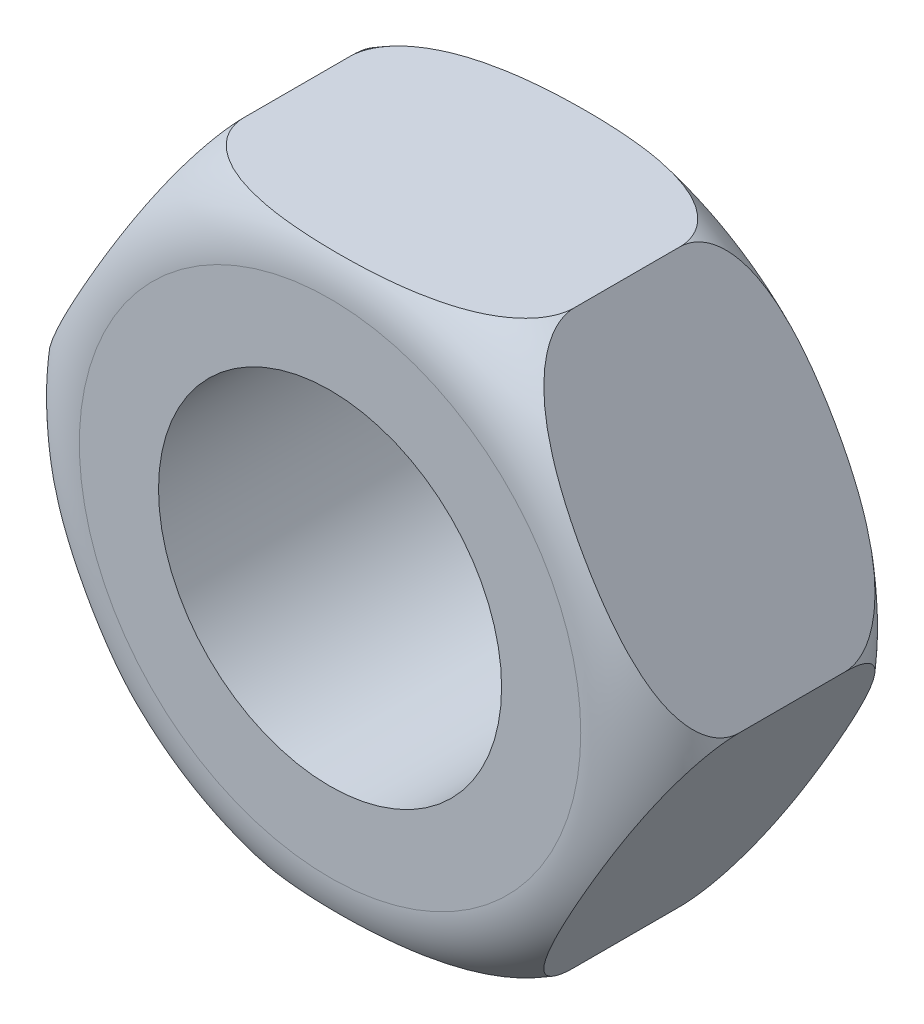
ISO-10303-21;
HEADER;
FILE_DESCRIPTION(('STEP AP214'),'2;1');
FILE_NAME('part.step','',(''),(''),'','','');
FILE_SCHEMA(('AUTOMOTIVE_DESIGN { 1 0 10303 214 1 1 1 1 }'));
ENDSEC;
DATA;
#1=APPLICATION_CONTEXT('core data for automotive mechanical design processes');
#2=APPLICATION_PROTOCOL_DEFINITION('international standard','automotive_design',2000,#1);
#3=PRODUCT_CONTEXT('',#1,'mechanical');
#4=PRODUCT('Part','Part','',(#3));
#5=PRODUCT_RELATED_PRODUCT_CATEGORY('part','',(#4));
#6=PRODUCT_DEFINITION_FORMATION('','',#4);
#7=PRODUCT_DEFINITION_CONTEXT('part definition',#1,'design');
#8=PRODUCT_DEFINITION('design','',#6,#7);
#9=PRODUCT_DEFINITION_SHAPE('','',#8);
#10=(LENGTH_UNIT() NAMED_UNIT(*) SI_UNIT(.MILLI.,.METRE.));
#11=(NAMED_UNIT(*) PLANE_ANGLE_UNIT() SI_UNIT($,.RADIAN.));
#12=(NAMED_UNIT(*) SI_UNIT($,.STERADIAN.) SOLID_ANGLE_UNIT());
#13=UNCERTAINTY_MEASURE_WITH_UNIT(LENGTH_MEASURE(1.E-05),#10,'distance_accuracy_value','');
#14=(GEOMETRIC_REPRESENTATION_CONTEXT(3) GLOBAL_UNCERTAINTY_ASSIGNED_CONTEXT((#13)) GLOBAL_UNIT_ASSIGNED_CONTEXT((#10,
#11,#12)) REPRESENTATION_CONTEXT('',''));
#15=CARTESIAN_POINT('',(0.,0.,0.));
#16=DIRECTION('',(0.,0.,1.));
#17=DIRECTION('',(1.,0.,0.));
#18=AXIS2_PLACEMENT_3D('',#15,#16,#17);
#19=CARTESIAN_POINT('',(0.,0.,10.));
#20=DIRECTION('',(0.,0.,-1.));
#21=DIRECTION('',(-1.,0.,0.));
#22=AXIS2_PLACEMENT_3D('',#19,#20,#21);
#23=PLANE('',#22);
#24=CARTESIAN_POINT('',(0.,0.,10.));
#25=DIRECTION('',(0.,0.,-1.));
#26=DIRECTION('',(1.,0.,0.));
#27=AXIS2_PLACEMENT_3D('',#24,#25,#26);
#28=CIRCLE('',#27,9.50000000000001);
#29=CARTESIAN_POINT('',(9.50000000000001,0.,10.));
#30=VERTEX_POINT('',#29);
#31=EDGE_CURVE('E60',#30,#30,#28,.T.);
#32=ORIENTED_EDGE('',*,*,#31,.F.);
#33=EDGE_LOOP('',(#32));
#34=FACE_BOUND('',#33,.T.);
#35=CARTESIAN_POINT('',(0.,0.,10.));
#36=DIRECTION('',(0.,0.,1.));
#37=DIRECTION('',(1.,0.,0.));
#38=AXIS2_PLACEMENT_3D('',#35,#36,#37);
#39=CIRCLE('',#38,6.49999999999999);
#40=CARTESIAN_POINT('',(6.49999999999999,0.,10.));
#41=VERTEX_POINT('',#40);
#42=EDGE_CURVE('E242',#41,#41,#39,.T.);
#43=ORIENTED_EDGE('',*,*,#42,.F.);
#44=EDGE_LOOP('',(#43));
#45=FACE_BOUND('',#44,.T.);
#46=ADVANCED_FACE('F48',(#34,#45),#23,.F.);
#47=CARTESIAN_POINT('',(6.25,-10.8253175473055,10.));
#48=DIRECTION('',(0.866025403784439,-0.5,0.));
#49=DIRECTION('',(0.5,0.866025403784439,0.));
#50=AXIS2_PLACEMENT_3D('',#47,#48,#49);
#51=PLANE('',#50);
#52=CARTESIAN_POINT('',(12.5,0.,3.));
#53=CARTESIAN_POINT('',(12.500007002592,1.21288451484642E-05,2.95551075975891));
#54=CARTESIAN_POINT('',(12.4990105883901,-0.00171371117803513,2.91102889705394));
#55=CARTESIAN_POINT('',(12.4950645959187,-0.00854837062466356,2.82244259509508));
#56=CARTESIAN_POINT('',(12.4921163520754,-0.0136548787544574,2.77833791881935));
#57=CARTESIAN_POINT('',(12.4843503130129,-0.0271060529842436,2.69114467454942));
#58=CARTESIAN_POINT('',(12.4795471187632,-0.035425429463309,2.64805089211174));
#59=CARTESIAN_POINT('',(12.468167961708,-0.0551347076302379,2.56281661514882));
#60=CARTESIAN_POINT('',(12.4615917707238,-0.0665250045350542,2.52067624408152));
#61=CARTESIAN_POINT('',(12.4394093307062,-0.104946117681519,2.39627380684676));
#62=CARTESIAN_POINT('',(12.4213220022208,-0.136274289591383,2.31573765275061));
#63=CARTESIAN_POINT('',(12.3795919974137,-0.208552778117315,2.1605889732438));
#64=CARTESIAN_POINT('',(12.3559378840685,-0.249522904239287,2.08598907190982));
#65=CARTESIAN_POINT('',(12.2891741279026,-0.365161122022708,1.90200236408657));
#66=CARTESIAN_POINT('',(12.2427256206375,-0.445612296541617,1.79745723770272));
#67=CARTESIAN_POINT('',(12.1422240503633,-0.619686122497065,1.60421953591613));
#68=CARTESIAN_POINT('',(12.0881525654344,-0.713340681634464,1.5155665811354));
#69=CARTESIAN_POINT('',(11.9847571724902,-0.892426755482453,1.36669279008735));
#70=CARTESIAN_POINT('',(11.9362321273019,-0.976474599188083,1.30420679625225));
#71=CARTESIAN_POINT('',(11.8366366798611,-1.14897897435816,1.18786652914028));
#72=CARTESIAN_POINT('',(11.7855644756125,-1.23743862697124,1.1340184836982));
#73=CARTESIAN_POINT('',(11.6815341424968,-1.41762444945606,1.03388098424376));
#74=CARTESIAN_POINT('',(11.6285735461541,-1.50935489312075,0.987601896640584));
#75=CARTESIAN_POINT('',(11.5213435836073,-1.69508263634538,0.901746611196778));
#76=CARTESIAN_POINT('',(11.4670745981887,-1.78907927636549,0.862168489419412));
#77=CARTESIAN_POINT('',(11.31472577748,-2.05295517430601,0.760137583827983));
#78=CARTESIAN_POINT('',(11.2155861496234,-2.22467004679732,0.704012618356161));
#79=CARTESIAN_POINT('',(11.015430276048,-2.57135018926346,0.606219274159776));
#80=CARTESIAN_POINT('',(10.9144111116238,-2.7463205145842,0.564575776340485));
#81=CARTESIAN_POINT('',(10.7112829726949,-3.09814877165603,0.492792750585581));
#82=CARTESIAN_POINT('',(10.6091731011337,-3.27500825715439,0.462663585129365));
#83=CARTESIAN_POINT('',(10.4036006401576,-3.63107020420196,0.411460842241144));
#84=CARTESIAN_POINT('',(10.300133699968,-3.81028020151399,0.390459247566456));
#85=CARTESIAN_POINT('',(10.0930021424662,-4.16904258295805,0.356160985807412));
#86=CARTESIAN_POINT('',(9.98933785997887,-4.34859438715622,0.342856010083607));
#87=CARTESIAN_POINT('',(9.78188924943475,-4.70790592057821,0.322792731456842));
#88=CARTESIAN_POINT('',(9.6781049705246,-4.88766556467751,0.316032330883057));
#89=CARTESIAN_POINT('',(9.46105985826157,-5.26359872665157,0.308110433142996));
#90=CARTESIAN_POINT('',(9.34779392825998,-5.45978107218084,0.307512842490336));
#91=CARTESIAN_POINT('',(9.12126565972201,-5.85213954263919,0.313320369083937));
#92=CARTESIAN_POINT('',(9.00800333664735,-6.04831564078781,0.319727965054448));
#93=CARTESIAN_POINT('',(8.78154059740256,-6.440560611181,0.340230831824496));
#94=CARTESIAN_POINT('',(8.66834033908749,-6.63662921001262,0.354333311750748));
#95=CARTESIAN_POINT('',(8.44326943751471,-7.02646344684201,0.391502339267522));
#96=CARTESIAN_POINT('',(8.33139570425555,-7.22023443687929,0.414491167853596));
#97=CARTESIAN_POINT('',(8.10843750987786,-7.60640935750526,0.471601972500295));
#98=CARTESIAN_POINT('',(7.99735248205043,-7.79881426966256,0.505714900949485));
#99=CARTESIAN_POINT('',(7.7766024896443,-8.18116447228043,0.588103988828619));
#100=CARTESIAN_POINT('',(7.66693570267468,-8.37111291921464,0.636359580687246));
#101=CARTESIAN_POINT('',(7.51530827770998,-8.63373932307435,0.716643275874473));
#102=CARTESIAN_POINT('',(7.47231882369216,-8.70819924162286,0.740961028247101));
#103=CARTESIAN_POINT('',(7.38682553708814,-8.85627795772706,0.792842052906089));
#104=CARTESIAN_POINT('',(7.34432173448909,-8.9298967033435,0.820405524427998));
#105=CARTESIAN_POINT('',(7.25986753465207,-9.07617566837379,0.879178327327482));
#106=CARTESIAN_POINT('',(7.21791815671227,-9.14883412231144,0.910393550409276));
#107=CARTESIAN_POINT('',(7.13481881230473,-9.29276640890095,0.976831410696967));
#108=CARTESIAN_POINT('',(7.09366882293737,-9.36404028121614,1.01205393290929));
#109=CARTESIAN_POINT('',(7.01206219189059,-9.50538711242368,1.08724986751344));
#110=CARTESIAN_POINT('',(6.97161356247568,-9.57544619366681,1.12725850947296));
#111=CARTESIAN_POINT('',(6.89205472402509,-9.71324614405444,1.21227747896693));
#112=CARTESIAN_POINT('',(6.85294489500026,-9.78098635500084,1.2572892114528));
#113=CARTESIAN_POINT('',(6.73829305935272,-9.9795691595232,1.40048051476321));
#114=CARTESIAN_POINT('',(6.66519506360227,-10.1061786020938,1.50702192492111));
#115=CARTESIAN_POINT('',(6.55593140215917,-10.2954288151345,1.70074972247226));
#116=CARTESIAN_POINT('',(6.51625395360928,-10.364152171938,1.7800155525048));
#117=CARTESIAN_POINT('',(6.44294961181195,-10.4911190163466,1.9491657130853));
#118=CARTESIAN_POINT('',(6.4093175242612,-10.549371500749,2.03904081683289));
#119=CARTESIAN_POINT('',(6.35450632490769,-10.6443072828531,2.21508650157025));
#120=CARTESIAN_POINT('',(6.33222495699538,-10.6828997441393,2.29987334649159));
#121=CARTESIAN_POINT('',(6.29503077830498,-10.7473219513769,2.47562533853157));
#122=CARTESIAN_POINT('',(6.28010139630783,-10.7731803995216,2.56657606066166));
#123=CARTESIAN_POINT('',(6.26303663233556,-10.8027374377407,2.71519123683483));
#124=CARTESIAN_POINT('',(6.25817280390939,-10.8111618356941,2.77163886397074));
#125=CARTESIAN_POINT('',(6.25164429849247,-10.8224695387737,2.88537478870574));
#126=CARTESIAN_POINT('',(6.24998572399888,-10.8253422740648,2.9426644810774));
#127=CARTESIAN_POINT('',(6.25,-10.8253175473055,3.));
#128=B_SPLINE_CURVE_WITH_KNOTS('',3,(#52,#53,#54,#55,#56,#57,#58,#59,#60,#61,#62,#63,#64,#65,
#66,#67,#68,#69,#70,#71,#72,#73,#74,#75,#76,#77,#78,#79,#80,#81,#82,#83,#84,#85,#86,#87,#88,#89,
#90,#91,#92,#93,#94,#95,#96,#97,#98,#99,#100,#101,#102,#103,#104,#105,#106,#107,#108,#109,#110,
#111,#112,#113,#114,#115,#116,#117,#118,#119,#120,#121,#122,#123,#124,#125,#126,#127),
.UNSPECIFIED.,.F.,.F.,(4,2,2,2,2,2,2,2,2,2,2,2,2,2,2,2,2,2,2,2,2,2,2,2,2,2,2,2,2,2,2,2,2,2,2,2,
2,4),(0.,0.13341107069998,0.26673102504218,0.399022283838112,0.53133057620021,0.795064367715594,
1.05934480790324,1.47651216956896,1.89470552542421,2.24049490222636,2.58653247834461,
2.93304008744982,3.27944804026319,3.89686088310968,4.51532933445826,5.13435308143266,
5.7581737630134,6.38131975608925,7.00426595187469,7.68375640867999,8.363487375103,
9.04385625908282,9.71840464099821,10.3924057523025,11.0654314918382,11.33343593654,
11.6014568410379,11.8699162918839,12.1383680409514,12.4089338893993,12.6795759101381,
13.2193387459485,13.5549504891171,13.8902724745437,14.1765064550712,14.4620922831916,
14.6335943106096,14.8054225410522),.UNSPECIFIED.);
#129=CARTESIAN_POINT('',(12.5,0.,3.));
#130=VERTEX_POINT('',#129);
#131=CARTESIAN_POINT('',(6.25,-10.8253175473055,3.));
#132=VERTEX_POINT('',#131);
#133=EDGE_CURVE('E281',#130,#132,#128,.T.);
#134=ORIENTED_EDGE('',*,*,#133,.F.);
#135=DIRECTION('',(0.,0.,1.));
#136=VECTOR('',#135,1.);
#137=CARTESIAN_POINT('',(12.5,0.,10.));
#138=LINE('',#137,#136);
#139=CARTESIAN_POINT('',(12.5,0.,7.));
#140=VERTEX_POINT('',#139);
#141=EDGE_CURVE('E100',#140,#130,#138,.F.);
#142=ORIENTED_EDGE('',*,*,#141,.F.);
#143=CARTESIAN_POINT('',(6.25,-10.8253175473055,7.));
#144=CARTESIAN_POINT('',(6.24999299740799,-10.8253296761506,7.04448924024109));
#145=CARTESIAN_POINT('',(6.25098941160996,-10.8236038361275,7.08897110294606));
#146=CARTESIAN_POINT('',(6.25493540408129,-10.8167691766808,7.17755740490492));
#147=CARTESIAN_POINT('',(6.25788364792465,-10.811662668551,7.22166208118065));
#148=CARTESIAN_POINT('',(6.26564968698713,-10.7982114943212,7.30885532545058));
#149=CARTESIAN_POINT('',(6.27045288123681,-10.7898921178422,7.35194910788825));
#150=CARTESIAN_POINT('',(6.28183203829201,-10.7701828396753,7.43718338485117));
#151=CARTESIAN_POINT('',(6.28840822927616,-10.7587925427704,7.47932375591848));
#152=CARTESIAN_POINT('',(6.31059066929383,-10.720371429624,7.60372619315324));
#153=CARTESIAN_POINT('',(6.32867799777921,-10.6890432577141,7.68426234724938));
#154=CARTESIAN_POINT('',(6.37040800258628,-10.6167647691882,7.8394110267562));
#155=CARTESIAN_POINT('',(6.39406211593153,-10.5757946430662,7.91401092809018));
#156=CARTESIAN_POINT('',(6.4608258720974,-10.4601564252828,8.09799763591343));
#157=CARTESIAN_POINT('',(6.50727437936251,-10.3797052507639,8.20254276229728));
#158=CARTESIAN_POINT('',(6.60777594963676,-10.2056314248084,8.39578046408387));
#159=CARTESIAN_POINT('',(6.66184743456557,-10.111976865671,8.4844334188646));
#160=CARTESIAN_POINT('',(6.76524282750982,-9.93289079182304,8.63330720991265));
#161=CARTESIAN_POINT('',(6.81376787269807,-9.84884294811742,8.69579320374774));
#162=CARTESIAN_POINT('',(6.9133633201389,-9.67633857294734,8.81213347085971));
#163=CARTESIAN_POINT('',(6.96443552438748,-9.58787892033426,8.86598151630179));
#164=CARTESIAN_POINT('',(7.06846585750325,-9.40769309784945,8.96611901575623));
#165=CARTESIAN_POINT('',(7.12142645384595,-9.31596265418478,9.01239810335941));
#166=CARTESIAN_POINT('',(7.22865641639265,-9.1302349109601,9.09825338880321));
#167=CARTESIAN_POINT('',(7.28292540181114,-9.03623827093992,9.13783151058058));
#168=CARTESIAN_POINT('',(7.43527422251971,-8.77236237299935,9.23986241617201));
#169=CARTESIAN_POINT('',(7.5344138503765,-8.60064750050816,9.29598738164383));
#170=CARTESIAN_POINT('',(7.73456972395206,-8.25396735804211,9.39378072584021));
#171=CARTESIAN_POINT('',(7.83558888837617,-8.07899703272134,9.43542422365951));
#172=CARTESIAN_POINT('',(8.03871702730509,-7.72716877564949,9.50720724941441));
#173=CARTESIAN_POINT('',(8.14082689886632,-7.55030929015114,9.53733641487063));
#174=CARTESIAN_POINT('',(8.34639935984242,-7.19424734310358,9.58853915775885));
#175=CARTESIAN_POINT('',(8.44986630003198,-7.01503734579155,9.60954075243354));
#176=CARTESIAN_POINT('',(8.65699785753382,-6.65627496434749,9.64383901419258));
#177=CARTESIAN_POINT('',(8.76066214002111,-6.47672316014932,9.65714398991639));
#178=CARTESIAN_POINT('',(8.96811075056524,-6.11741162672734,9.67720726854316));
#179=CARTESIAN_POINT('',(9.07189502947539,-5.93765198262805,9.68396766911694));
#180=CARTESIAN_POINT('',(9.28894014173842,-5.56171882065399,9.691889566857));
#181=CARTESIAN_POINT('',(9.40220607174,-5.36553647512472,9.69248715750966));
#182=CARTESIAN_POINT('',(9.62873434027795,-4.97317800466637,9.68667963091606));
#183=CARTESIAN_POINT('',(9.74199666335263,-4.77700190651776,9.68027203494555));
#184=CARTESIAN_POINT('',(9.96845940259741,-4.38475693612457,9.65976916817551));
#185=CARTESIAN_POINT('',(10.0816596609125,-4.18868833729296,9.64566668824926));
#186=CARTESIAN_POINT('',(10.3067305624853,-3.79885410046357,9.60849766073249));
#187=CARTESIAN_POINT('',(10.4186042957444,-3.60508311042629,9.58550883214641));
#188=CARTESIAN_POINT('',(10.6415624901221,-3.21890818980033,9.52839802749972));
#189=CARTESIAN_POINT('',(10.7526475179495,-3.02650327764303,9.49428509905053));
#190=CARTESIAN_POINT('',(10.9733975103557,-2.64415307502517,9.41189601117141));
#191=CARTESIAN_POINT('',(11.0830642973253,-2.45420462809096,9.36364041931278));
#192=CARTESIAN_POINT('',(11.23469172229,-2.19157822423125,9.28335672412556));
#193=CARTESIAN_POINT('',(11.2776811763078,-2.11711830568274,9.25903897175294));
#194=CARTESIAN_POINT('',(11.3631744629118,-1.96903958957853,9.20715794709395));
#195=CARTESIAN_POINT('',(11.4056782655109,-1.89542084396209,9.17959447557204));
#196=CARTESIAN_POINT('',(11.4901324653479,-1.74914187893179,9.12082167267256));
#197=CARTESIAN_POINT('',(11.5320818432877,-1.67648342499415,9.08960644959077));
#198=CARTESIAN_POINT('',(11.6151811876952,-1.53255113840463,9.02316858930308));
#199=CARTESIAN_POINT('',(11.6563311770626,-1.46127726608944,8.98794606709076));
#200=CARTESIAN_POINT('',(11.7379378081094,-1.31993043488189,8.91275013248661));
#201=CARTESIAN_POINT('',(11.7783864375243,-1.24987135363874,8.87274149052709));
#202=CARTESIAN_POINT('',(11.8579452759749,-1.11207140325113,8.78772252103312));
#203=CARTESIAN_POINT('',(11.8970551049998,-1.04433119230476,8.74271078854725));
#204=CARTESIAN_POINT('',(12.0117069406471,-0.845748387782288,8.59951948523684));
#205=CARTESIAN_POINT('',(12.0848049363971,-0.71913894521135,8.49297807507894));
#206=CARTESIAN_POINT('',(12.1940685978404,-0.529888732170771,8.2992502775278));
#207=CARTESIAN_POINT('',(12.2337460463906,-0.46116537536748,8.21998444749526));
#208=CARTESIAN_POINT('',(12.3070503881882,-0.334198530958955,8.05083428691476));
#209=CARTESIAN_POINT('',(12.3406824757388,-0.275946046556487,7.96095918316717));
#210=CARTESIAN_POINT('',(12.3954936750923,-0.181010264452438,7.78491349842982));
#211=CARTESIAN_POINT('',(12.4177750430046,-0.142417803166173,7.70012665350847));
#212=CARTESIAN_POINT('',(12.454969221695,-0.0779955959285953,7.52437466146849));
#213=CARTESIAN_POINT('',(12.4698986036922,-0.0521371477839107,7.4334239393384));
#214=CARTESIAN_POINT('',(12.4869633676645,-0.0225801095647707,7.28480876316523));
#215=CARTESIAN_POINT('',(12.4918271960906,-0.0141557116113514,7.2283611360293));
#216=CARTESIAN_POINT('',(12.4983557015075,-0.0028480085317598,7.11462521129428));
#217=CARTESIAN_POINT('',(12.5000142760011,2.47267592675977E-05,7.05733551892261));
#218=CARTESIAN_POINT('',(12.5,0.,7.));
#219=B_SPLINE_CURVE_WITH_KNOTS('',3,(#143,#144,#145,#146,#147,#148,#149,#150,#151,#152,#153,
#154,#155,#156,#157,#158,#159,#160,#161,#162,#163,#164,#165,#166,#167,#168,#169,#170,#171,#172,
#173,#174,#175,#176,#177,#178,#179,#180,#181,#182,#183,#184,#185,#186,#187,#188,#189,#190,#191,
#192,#193,#194,#195,#196,#197,#198,#199,#200,#201,#202,#203,#204,#205,#206,#207,#208,#209,#210,
#211,#212,#213,#214,#215,#216,#217,#218),.UNSPECIFIED.,.F.,.F.,(4,2,2,2,2,2,2,2,2,2,2,2,2,2,2,2,
2,2,2,2,2,2,2,2,2,2,2,2,2,2,2,2,2,2,2,2,2,4),(0.,0.133411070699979,0.266731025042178,
0.399022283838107,0.531330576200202,0.795064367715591,1.05934480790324,1.47651216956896,
1.8947055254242,2.24049490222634,2.58653247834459,2.93304008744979,3.27944804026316,
3.89686088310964,4.51532933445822,5.13435308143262,5.75817376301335,6.38131975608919,
7.00426595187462,7.68375640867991,8.3634873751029,9.04385625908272,9.7184046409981,
10.3924057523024,11.065431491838,11.3334359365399,11.6014568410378,11.8699162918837,
12.1383680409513,12.4089338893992,12.679575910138,13.2193387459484,13.554950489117,
13.8902724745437,14.1765064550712,14.4620922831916,14.6335943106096,14.8054225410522),.UNSPECIFIED.);
#220=CARTESIAN_POINT('',(6.25,-10.8253175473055,7.));
#221=VERTEX_POINT('',#220);
#222=EDGE_CURVE('E122',#221,#140,#219,.T.);
#223=ORIENTED_EDGE('',*,*,#222,.F.);
#224=DIRECTION('',(0.,0.,-1.));
#225=VECTOR('',#224,1.);
#226=CARTESIAN_POINT('',(6.25,-10.8253175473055,10.));
#227=LINE('',#226,#225);
#228=EDGE_CURVE('E233',#132,#221,#227,.F.);
#229=ORIENTED_EDGE('',*,*,#228,.F.);
#230=EDGE_LOOP('',(#134,#142,#223,#229));
#231=FACE_BOUND('',#230,.T.);
#232=ADVANCED_FACE('F50',(#231),#51,.T.);
#233=CARTESIAN_POINT('',(-6.25,-10.8253175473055,10.));
#234=DIRECTION('',(0.,-1.,0.));
#235=DIRECTION('',(0.,0.,-1.));
#236=AXIS2_PLACEMENT_3D('',#233,#234,#235);
#237=PLANE('',#236);
#238=CARTESIAN_POINT('',(6.25,-10.8253175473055,3.));
#239=CARTESIAN_POINT('',(6.25001400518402,-10.8253175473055,2.95551075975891));
#240=CARTESIAN_POINT('',(6.24802117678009,-10.8253175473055,2.91102889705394));
#241=CARTESIAN_POINT('',(6.24012919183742,-10.8253175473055,2.82244259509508));
#242=CARTESIAN_POINT('',(6.23423270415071,-10.8253175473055,2.77833791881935));
#243=CARTESIAN_POINT('',(6.21870062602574,-10.8253175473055,2.69114467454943));
#244=CARTESIAN_POINT('',(6.20909423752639,-10.8253175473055,2.64805089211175));
#245=CARTESIAN_POINT('',(6.18633592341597,-10.8253175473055,2.56281661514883));
#246=CARTESIAN_POINT('',(6.17318354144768,-10.8253175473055,2.52067624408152));
#247=CARTESIAN_POINT('',(6.12881866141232,-10.8253175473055,2.39627380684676));
#248=CARTESIAN_POINT('',(6.09264400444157,-10.8253175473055,2.31573765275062));
#249=CARTESIAN_POINT('',(6.00918399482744,-10.8253175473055,2.1605889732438));
#250=CARTESIAN_POINT('',(5.96187576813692,-10.8253175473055,2.08598907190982));
#251=CARTESIAN_POINT('',(5.82834825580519,-10.8253175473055,1.90200236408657));
#252=CARTESIAN_POINT('',(5.73545124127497,-10.8253175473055,1.79745723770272));
#253=CARTESIAN_POINT('',(5.53444810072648,-10.8253175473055,1.60421953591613));
#254=CARTESIAN_POINT('',(5.42630513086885,-10.8253175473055,1.5155665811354));
#255=CARTESIAN_POINT('',(5.21951434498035,-10.8253175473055,1.36669279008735));
#256=CARTESIAN_POINT('',(5.12246425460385,-10.8253175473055,1.30420679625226));
#257=CARTESIAN_POINT('',(4.92327335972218,-10.8253175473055,1.18786652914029));
#258=CARTESIAN_POINT('',(4.82112895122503,-10.8253175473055,1.13401848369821));
#259=CARTESIAN_POINT('',(4.61306828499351,-10.8253175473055,1.03388098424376));
#260=CARTESIAN_POINT('',(4.50714709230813,-10.8253175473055,0.987601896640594));
#261=CARTESIAN_POINT('',(4.29268716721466,-10.8253175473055,0.901746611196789));
#262=CARTESIAN_POINT('',(4.18414919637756,-10.8253175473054,0.862168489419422));
#263=CARTESIAN_POINT('',(3.8794515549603,-10.8253175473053,0.760137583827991));
#264=CARTESIAN_POINT('',(3.68117229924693,-10.8253175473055,0.704012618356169));
#265=CARTESIAN_POINT('',(3.28086055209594,-10.8253175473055,0.606219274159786));
#266=CARTESIAN_POINT('',(3.07882222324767,-10.8253175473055,0.564575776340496));
#267=CARTESIAN_POINT('',(2.67256594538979,-10.8253175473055,0.492792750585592));
#268=CARTESIAN_POINT('',(2.46834620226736,-10.8253175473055,0.462663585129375));
#269=CARTESIAN_POINT('',(2.05720128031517,-10.8253175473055,0.411460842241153));
#270=CARTESIAN_POINT('',(1.85026739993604,-10.8253175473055,0.390459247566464));
#271=CARTESIAN_POINT('',(1.43600428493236,-10.8253175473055,0.356160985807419));
#272=CARTESIAN_POINT('',(1.22867571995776,-10.8253175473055,0.342856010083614));
#273=CARTESIAN_POINT('',(0.813778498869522,-10.8253175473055,0.322792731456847));
#274=CARTESIAN_POINT('',(0.606209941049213,-10.8253175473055,0.316032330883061));
#275=CARTESIAN_POINT('',(0.172119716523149,-10.8253175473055,0.308110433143));
#276=CARTESIAN_POINT('',(-0.0544121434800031,-10.8253175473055,0.307512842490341));
#277=CARTESIAN_POINT('',(-0.50746868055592,-10.8253175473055,0.313320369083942));
#278=CARTESIAN_POINT('',(-0.733993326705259,-10.8253175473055,0.319727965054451));
#279=CARTESIAN_POINT('',(-1.18691880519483,-10.8253175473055,0.340230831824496));
#280=CARTESIAN_POINT('',(-1.41331932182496,-10.8253175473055,0.354333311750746));
#281=CARTESIAN_POINT('',(-1.86346112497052,-10.8253175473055,0.391502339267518));
#282=CARTESIAN_POINT('',(-2.08720859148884,-10.8253175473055,0.414491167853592));
#283=CARTESIAN_POINT('',(-2.53312498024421,-10.8253175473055,0.471601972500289));
#284=CARTESIAN_POINT('',(-2.75529503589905,-10.8253175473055,0.505714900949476));
#285=CARTESIAN_POINT('',(-3.19679502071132,-10.8253175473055,0.588103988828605));
#286=CARTESIAN_POINT('',(-3.41612859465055,-10.8253175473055,0.636359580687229));
#287=CARTESIAN_POINT('',(-3.71938344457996,-10.8253175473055,0.716643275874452));
#288=CARTESIAN_POINT('',(-3.8053623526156,-10.8253175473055,0.740961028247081));
#289=CARTESIAN_POINT('',(-3.97634892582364,-10.8253175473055,0.792842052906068));
#290=CARTESIAN_POINT('',(-4.06135653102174,-10.8253175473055,0.820405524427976));
#291=CARTESIAN_POINT('',(-4.23026493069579,-10.8253175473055,0.879178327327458));
#292=CARTESIAN_POINT('',(-4.31416368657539,-10.8253175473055,0.910393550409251));
#293=CARTESIAN_POINT('',(-4.48036237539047,-10.8253175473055,0.976831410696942));
#294=CARTESIAN_POINT('',(-4.56266235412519,-10.8253175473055,1.01205393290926));
#295=CARTESIAN_POINT('',(-4.72587561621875,-10.8253175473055,1.08724986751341));
#296=CARTESIAN_POINT('',(-4.80677287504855,-10.8253175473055,1.12725850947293));
#297=CARTESIAN_POINT('',(-4.96589055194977,-10.8253175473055,1.2122774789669));
#298=CARTESIAN_POINT('',(-5.04411020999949,-10.8253175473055,1.25728921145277));
#299=CARTESIAN_POINT('',(-5.27341388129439,-10.8253175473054,1.40048051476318));
#300=CARTESIAN_POINT('',(-5.41960987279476,-10.8253175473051,1.50702192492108));
#301=CARTESIAN_POINT('',(-5.63813719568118,-10.8253175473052,1.70074972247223));
#302=CARTESIAN_POINT('',(-5.71749209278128,-10.8253175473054,1.78001555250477));
#303=CARTESIAN_POINT('',(-5.86410077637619,-10.8253175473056,1.94916571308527));
#304=CARTESIAN_POINT('',(-5.93136495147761,-10.8253175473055,2.03904081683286));
#305=CARTESIAN_POINT('',(-6.04098735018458,-10.8253175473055,2.21508650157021));
#306=CARTESIAN_POINT('',(-6.08555008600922,-10.8253175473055,2.29987334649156));
#307=CARTESIAN_POINT('',(-6.15993844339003,-10.8253175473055,2.47562533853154));
#308=CARTESIAN_POINT('',(-6.18979720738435,-10.8253175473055,2.56657606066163));
#309=CARTESIAN_POINT('',(-6.22392673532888,-10.8253175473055,2.7151912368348));
#310=CARTESIAN_POINT('',(-6.23365439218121,-10.8253175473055,2.77163886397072));
#311=CARTESIAN_POINT('',(-6.24671140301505,-10.8253175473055,2.88537478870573));
#312=CARTESIAN_POINT('',(-6.25002855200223,-10.8253175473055,2.94266448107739));
#313=CARTESIAN_POINT('',(-6.25,-10.8253175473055,3.));
#314=B_SPLINE_CURVE_WITH_KNOTS('',3,(#238,#239,#240,#241,#242,#243,#244,#245,#246,#247,#248,
#249,#250,#251,#252,#253,#254,#255,#256,#257,#258,#259,#260,#261,#262,#263,#264,#265,#266,#267,
#268,#269,#270,#271,#272,#273,#274,#275,#276,#277,#278,#279,#280,#281,#282,#283,#284,#285,#286,
#287,#288,#289,#290,#291,#292,#293,#294,#295,#296,#297,#298,#299,#300,#301,#302,#303,#304,#305,
#306,#307,#308,#309,#310,#311,#312,#313),.UNSPECIFIED.,.F.,.F.,(4,2,2,2,2,2,2,2,2,2,2,2,2,2,2,2,
2,2,2,2,2,2,2,2,2,2,2,2,2,2,2,2,2,2,2,2,2,4),(0.,0.133411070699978,0.266731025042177,
0.399022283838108,0.531330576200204,0.795064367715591,1.05934480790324,1.47651216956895,
1.89470552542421,2.24049490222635,2.58653247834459,2.93304008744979,3.27944804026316,
3.89686088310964,4.51532933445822,5.13435308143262,5.75817376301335,6.38131975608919,
7.00426595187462,7.68375640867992,8.36348737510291,9.04385625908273,9.71840464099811,
10.3924057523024,11.065431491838,11.3334359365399,11.6014568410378,11.8699162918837,
12.1383680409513,12.4089338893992,12.679575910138,13.2193387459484,13.554950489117,
13.8902724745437,14.1765064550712,14.4620922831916,14.6335943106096,14.8054225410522),.UNSPECIFIED.);
#315=CARTESIAN_POINT('',(-6.25,-10.8253175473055,3.));
#316=VERTEX_POINT('',#315);
#317=EDGE_CURVE('E283',#132,#316,#314,.T.);
#318=ORIENTED_EDGE('',*,*,#317,.F.);
#319=ORIENTED_EDGE('',*,*,#228,.T.);
#320=CARTESIAN_POINT('',(-6.25,-10.8253175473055,7.));
#321=CARTESIAN_POINT('',(-6.25001400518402,-10.8253175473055,7.04448924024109));
#322=CARTESIAN_POINT('',(-6.24802117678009,-10.8253175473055,7.08897110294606));
#323=CARTESIAN_POINT('',(-6.24012919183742,-10.8253175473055,7.17755740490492));
#324=CARTESIAN_POINT('',(-6.23423270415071,-10.8253175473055,7.22166208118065));
#325=CARTESIAN_POINT('',(-6.21870062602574,-10.8253175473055,7.30885532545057));
#326=CARTESIAN_POINT('',(-6.20909423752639,-10.8253175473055,7.35194910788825));
#327=CARTESIAN_POINT('',(-6.18633592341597,-10.8253175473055,7.43718338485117));
#328=CARTESIAN_POINT('',(-6.17318354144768,-10.8253175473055,7.47932375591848));
#329=CARTESIAN_POINT('',(-6.12881866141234,-10.8253175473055,7.60372619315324));
#330=CARTESIAN_POINT('',(-6.09264400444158,-10.8253175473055,7.68426234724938));
#331=CARTESIAN_POINT('',(-6.00918399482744,-10.8253175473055,7.83941102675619));
#332=CARTESIAN_POINT('',(-5.96187576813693,-10.8253175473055,7.91401092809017));
#333=CARTESIAN_POINT('',(-5.8283482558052,-10.8253175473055,8.09799763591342));
#334=CARTESIAN_POINT('',(-5.73545124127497,-10.8253175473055,8.20254276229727));
#335=CARTESIAN_POINT('',(-5.53444810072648,-10.8253175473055,8.39578046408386));
#336=CARTESIAN_POINT('',(-5.42630513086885,-10.8253175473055,8.4844334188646));
#337=CARTESIAN_POINT('',(-5.21951434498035,-10.8253175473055,8.63330720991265));
#338=CARTESIAN_POINT('',(-5.12246425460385,-10.8253175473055,8.69579320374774));
#339=CARTESIAN_POINT('',(-4.92327335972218,-10.8253175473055,8.81213347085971));
#340=CARTESIAN_POINT('',(-4.82112895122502,-10.8253175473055,8.8659815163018));
#341=CARTESIAN_POINT('',(-4.6130682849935,-10.8253175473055,8.96611901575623));
#342=CARTESIAN_POINT('',(-4.50714709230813,-10.8253175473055,9.01239810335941));
#343=CARTESIAN_POINT('',(-4.29268716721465,-10.8253175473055,9.09825338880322));
#344=CARTESIAN_POINT('',(-4.18414919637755,-10.8253175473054,9.13783151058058));
#345=CARTESIAN_POINT('',(-3.87945155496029,-10.8253175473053,9.23986241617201));
#346=CARTESIAN_POINT('',(-3.68117229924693,-10.8253175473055,9.29598738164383));
#347=CARTESIAN_POINT('',(-3.28086055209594,-10.8253175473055,9.39378072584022));
#348=CARTESIAN_POINT('',(-3.07882222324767,-10.8253175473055,9.43542422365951));
#349=CARTESIAN_POINT('',(-2.67256594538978,-10.8253175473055,9.50720724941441));
#350=CARTESIAN_POINT('',(-2.46834620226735,-10.8253175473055,9.53733641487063));
#351=CARTESIAN_POINT('',(-2.05720128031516,-10.8253175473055,9.58853915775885));
#352=CARTESIAN_POINT('',(-1.85026739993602,-10.8253175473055,9.60954075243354));
#353=CARTESIAN_POINT('',(-1.43600428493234,-10.8253175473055,9.64383901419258));
#354=CARTESIAN_POINT('',(-1.22867571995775,-10.8253175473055,9.65714398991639));
#355=CARTESIAN_POINT('',(-0.813778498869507,-10.8253175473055,9.67720726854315));
#356=CARTESIAN_POINT('',(-0.606209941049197,-10.8253175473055,9.68396766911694));
#357=CARTESIAN_POINT('',(-0.172119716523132,-10.8253175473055,9.691889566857));
#358=CARTESIAN_POINT('',(0.0544121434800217,-10.8253175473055,9.69248715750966));
#359=CARTESIAN_POINT('',(0.507468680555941,-10.8253175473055,9.68667963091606));
#360=CARTESIAN_POINT('',(0.733993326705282,-10.8253175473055,9.68027203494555));
#361=CARTESIAN_POINT('',(1.18691880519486,-10.8253175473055,9.6597691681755));
#362=CARTESIAN_POINT('',(1.41331932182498,-10.8253175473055,9.64566668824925));
#363=CARTESIAN_POINT('',(1.86346112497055,-10.8253175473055,9.60849766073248));
#364=CARTESIAN_POINT('',(2.08720859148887,-10.8253175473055,9.58550883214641));
#365=CARTESIAN_POINT('',(2.53312498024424,-10.8253175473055,9.52839802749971));
#366=CARTESIAN_POINT('',(2.75529503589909,-10.8253175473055,9.49428509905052));
#367=CARTESIAN_POINT('',(3.19679502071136,-10.8253175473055,9.41189601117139));
#368=CARTESIAN_POINT('',(3.41612859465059,-10.8253175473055,9.36364041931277));
#369=CARTESIAN_POINT('',(3.71938344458,-10.8253175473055,9.28335672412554));
#370=CARTESIAN_POINT('',(3.80536235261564,-10.8253175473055,9.25903897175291));
#371=CARTESIAN_POINT('',(3.97634892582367,-10.8253175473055,9.20715794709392));
#372=CARTESIAN_POINT('',(4.06135653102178,-10.8253175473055,9.17959447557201));
#373=CARTESIAN_POINT('',(4.23026493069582,-10.8253175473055,9.12082167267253));
#374=CARTESIAN_POINT('',(4.31416368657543,-10.8253175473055,9.08960644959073));
#375=CARTESIAN_POINT('',(4.4803623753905,-10.8253175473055,9.02316858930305));
#376=CARTESIAN_POINT('',(4.56266235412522,-10.8253175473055,8.98794606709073));
#377=CARTESIAN_POINT('',(4.72587561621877,-10.8253175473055,8.91275013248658));
#378=CARTESIAN_POINT('',(4.80677287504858,-10.8253175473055,8.87274149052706));
#379=CARTESIAN_POINT('',(4.9658905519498,-10.8253175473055,8.78772252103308));
#380=CARTESIAN_POINT('',(5.04411020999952,-10.8253175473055,8.74271078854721));
#381=CARTESIAN_POINT('',(5.27341388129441,-10.8253175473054,8.59951948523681));
#382=CARTESIAN_POINT('',(5.41960987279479,-10.8253175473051,8.49297807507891));
#383=CARTESIAN_POINT('',(5.63813719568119,-10.8253175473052,8.29925027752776));
#384=CARTESIAN_POINT('',(5.71749209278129,-10.8253175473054,8.21998444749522));
#385=CARTESIAN_POINT('',(5.8641007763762,-10.8253175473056,8.05083428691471));
#386=CARTESIAN_POINT('',(5.93136495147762,-10.8253175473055,7.96095918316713));
#387=CARTESIAN_POINT('',(6.04098735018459,-10.8253175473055,7.78491349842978));
#388=CARTESIAN_POINT('',(6.08555008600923,-10.8253175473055,7.70012665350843));
#389=CARTESIAN_POINT('',(6.15993844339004,-10.8253175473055,7.52437466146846));
#390=CARTESIAN_POINT('',(6.18979720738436,-10.8253175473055,7.43342393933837));
#391=CARTESIAN_POINT('',(6.22392673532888,-10.8253175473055,7.2848087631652));
#392=CARTESIAN_POINT('',(6.23365439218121,-10.8253175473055,7.22836113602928));
#393=CARTESIAN_POINT('',(6.24671140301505,-10.8253175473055,7.11462521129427));
#394=CARTESIAN_POINT('',(6.25002855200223,-10.8253175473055,7.05733551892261));
#395=CARTESIAN_POINT('',(6.25,-10.8253175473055,7.));
#396=B_SPLINE_CURVE_WITH_KNOTS('',3,(#320,#321,#322,#323,#324,#325,#326,#327,#328,#329,#330,
#331,#332,#333,#334,#335,#336,#337,#338,#339,#340,#341,#342,#343,#344,#345,#346,#347,#348,#349,
#350,#351,#352,#353,#354,#355,#356,#357,#358,#359,#360,#361,#362,#363,#364,#365,#366,#367,#368,
#369,#370,#371,#372,#373,#374,#375,#376,#377,#378,#379,#380,#381,#382,#383,#384,#385,#386,#387,
#388,#389,#390,#391,#392,#393,#394,#395),.UNSPECIFIED.,.F.,.F.,(4,2,2,2,2,2,2,2,2,2,2,2,2,2,2,2,
2,2,2,2,2,2,2,2,2,2,2,2,2,2,2,2,2,2,2,2,2,4),(0.,0.133411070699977,0.266731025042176,
0.399022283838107,0.531330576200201,0.795064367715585,1.05934480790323,1.47651216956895,
1.89470552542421,2.24049490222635,2.5865324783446,2.9330400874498,3.27944804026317,
3.89686088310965,4.51532933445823,5.13435308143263,5.75817376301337,6.38131975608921,
7.00426595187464,7.68375640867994,8.36348737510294,9.04385625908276,9.71840464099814,
10.3924057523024,11.0654314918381,11.33343593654,11.6014568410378,11.8699162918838,
12.1383680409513,12.4089338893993,12.6795759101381,13.2193387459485,13.554950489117,
13.8902724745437,14.1765064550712,14.4620922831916,14.6335943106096,14.8054225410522),.UNSPECIFIED.);
#397=CARTESIAN_POINT('',(-6.25,-10.8253175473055,7.));
#398=VERTEX_POINT('',#397);
#399=EDGE_CURVE('E289',#398,#221,#396,.T.);
#400=ORIENTED_EDGE('',*,*,#399,.F.);
#401=DIRECTION('',(0.,0.,1.));
#402=VECTOR('',#401,1.);
#403=CARTESIAN_POINT('',(-6.25,-10.8253175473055,10.));
#404=LINE('',#403,#402);
#405=EDGE_CURVE('E231',#316,#398,#404,.T.);
#406=ORIENTED_EDGE('',*,*,#405,.F.);
#407=EDGE_LOOP('',(#318,#319,#400,#406));
#408=FACE_BOUND('',#407,.T.);
#409=ADVANCED_FACE('F271',(#408),#237,.T.);
#410=CARTESIAN_POINT('',(-12.5,0.,10.));
#411=DIRECTION('',(-0.866025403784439,-0.5,0.));
#412=DIRECTION('',(0.5,-0.866025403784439,0.));
#413=AXIS2_PLACEMENT_3D('',#410,#411,#412);
#414=PLANE('',#413);
#415=CARTESIAN_POINT('',(-6.25,-10.8253175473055,3.));
#416=CARTESIAN_POINT('',(-6.24999299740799,-10.8253296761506,2.95551075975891));
#417=CARTESIAN_POINT('',(-6.25098941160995,-10.8236038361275,2.91102889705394));
#418=CARTESIAN_POINT('',(-6.25493540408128,-10.8167691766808,2.82244259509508));
#419=CARTESIAN_POINT('',(-6.25788364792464,-10.811662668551,2.77833791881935));
#420=CARTESIAN_POINT('',(-6.26564968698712,-10.7982114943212,2.69114467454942));
#421=CARTESIAN_POINT('',(-6.2704528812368,-10.7898921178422,2.64805089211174));
#422=CARTESIAN_POINT('',(-6.28183203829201,-10.7701828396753,2.56281661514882));
#423=CARTESIAN_POINT('',(-6.28840822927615,-10.7587925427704,2.52067624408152));
#424=CARTESIAN_POINT('',(-6.31059066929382,-10.720371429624,2.39627380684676));
#425=CARTESIAN_POINT('',(-6.32867799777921,-10.6890432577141,2.31573765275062));
#426=CARTESIAN_POINT('',(-6.37040800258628,-10.6167647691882,2.1605889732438));
#427=CARTESIAN_POINT('',(-6.39406211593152,-10.5757946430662,2.08598907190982));
#428=CARTESIAN_POINT('',(-6.46082587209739,-10.4601564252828,1.90200236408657));
#429=CARTESIAN_POINT('',(-6.50727437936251,-10.3797052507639,1.79745723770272));
#430=CARTESIAN_POINT('',(-6.60777594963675,-10.2056314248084,1.60421953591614));
#431=CARTESIAN_POINT('',(-6.66184743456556,-10.111976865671,1.51556658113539));
#432=CARTESIAN_POINT('',(-6.76524282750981,-9.93289079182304,1.36669279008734));
#433=CARTESIAN_POINT('',(-6.81376787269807,-9.84884294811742,1.30420679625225));
#434=CARTESIAN_POINT('',(-6.9133633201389,-9.67633857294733,1.18786652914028));
#435=CARTESIAN_POINT('',(-6.96443552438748,-9.58787892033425,1.1340184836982));
#436=CARTESIAN_POINT('',(-7.06846585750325,-9.40769309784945,1.03388098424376));
#437=CARTESIAN_POINT('',(-7.12142645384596,-9.31596265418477,0.987601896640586));
#438=CARTESIAN_POINT('',(-7.22865641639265,-9.13023491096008,0.901746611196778));
#439=CARTESIAN_POINT('',(-7.28292540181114,-9.0362382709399,0.862168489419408));
#440=CARTESIAN_POINT('',(-7.43527422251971,-8.77236237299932,0.760137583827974));
#441=CARTESIAN_POINT('',(-7.5344138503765,-8.60064750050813,0.704012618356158));
#442=CARTESIAN_POINT('',(-7.73456972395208,-8.25396735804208,0.606219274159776));
#443=CARTESIAN_POINT('',(-7.83558888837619,-8.07899703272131,0.564575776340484));
#444=CARTESIAN_POINT('',(-8.03871702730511,-7.72716877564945,0.492792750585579));
#445=CARTESIAN_POINT('',(-8.14082689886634,-7.55030929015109,0.462663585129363));
#446=CARTESIAN_POINT('',(-8.34639935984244,-7.19424734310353,0.411460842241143));
#447=CARTESIAN_POINT('',(-8.44986630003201,-7.0150373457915,0.390459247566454));
#448=CARTESIAN_POINT('',(-8.65699785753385,-6.65627496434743,0.356160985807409));
#449=CARTESIAN_POINT('',(-8.76066214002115,-6.47672316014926,0.342856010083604));
#450=CARTESIAN_POINT('',(-8.96811075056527,-6.11741162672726,0.322792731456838));
#451=CARTESIAN_POINT('',(-9.07189502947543,-5.93765198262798,0.316032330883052));
#452=CARTESIAN_POINT('',(-9.28894014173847,-5.56171882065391,0.308110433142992));
#453=CARTESIAN_POINT('',(-9.40220607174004,-5.36553647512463,0.307512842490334));
#454=CARTESIAN_POINT('',(-9.628734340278,-4.97317800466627,0.313320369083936));
#455=CARTESIAN_POINT('',(-9.74199666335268,-4.77700190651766,0.319727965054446));
#456=CARTESIAN_POINT('',(-9.96845940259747,-4.38475693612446,0.340230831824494));
#457=CARTESIAN_POINT('',(-10.0816596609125,-4.18868833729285,0.354333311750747));
#458=CARTESIAN_POINT('',(-10.3067305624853,-3.79885410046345,0.391502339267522));
#459=CARTESIAN_POINT('',(-10.4186042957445,-3.60508311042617,0.414491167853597));
#460=CARTESIAN_POINT('',(-10.6415624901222,-3.2189081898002,0.471601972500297));
#461=CARTESIAN_POINT('',(-10.7526475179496,-3.0265032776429,0.505714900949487));
#462=CARTESIAN_POINT('',(-10.9733975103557,-2.64415307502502,0.588103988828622));
#463=CARTESIAN_POINT('',(-11.0830642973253,-2.45420462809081,0.636359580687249));
#464=CARTESIAN_POINT('',(-11.23469172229,-2.19157822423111,0.716643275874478));
#465=CARTESIAN_POINT('',(-11.2776811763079,-2.1171183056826,0.740961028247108));
#466=CARTESIAN_POINT('',(-11.3631744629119,-1.9690395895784,0.792842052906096));
#467=CARTESIAN_POINT('',(-11.4056782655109,-1.89542084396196,0.820405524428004));
#468=CARTESIAN_POINT('',(-11.490132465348,-1.74914187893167,0.879178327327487));
#469=CARTESIAN_POINT('',(-11.5320818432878,-1.67648342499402,0.910393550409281));
#470=CARTESIAN_POINT('',(-11.6151811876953,-1.53255113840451,0.976831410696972));
#471=CARTESIAN_POINT('',(-11.6563311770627,-1.46127726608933,1.01205393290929));
#472=CARTESIAN_POINT('',(-11.7379378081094,-1.31993043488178,1.08724986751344));
#473=CARTESIAN_POINT('',(-11.7783864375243,-1.24987135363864,1.12725850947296));
#474=CARTESIAN_POINT('',(-11.8579452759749,-1.11207140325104,1.21227747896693));
#475=CARTESIAN_POINT('',(-11.8970551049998,-1.04433119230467,1.25728921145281));
#476=CARTESIAN_POINT('',(-12.0117069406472,-0.845748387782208,1.40048051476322));
#477=CARTESIAN_POINT('',(-12.0848049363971,-0.719138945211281,1.50702192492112));
#478=CARTESIAN_POINT('',(-12.1940685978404,-0.52988873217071,1.70074972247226));
#479=CARTESIAN_POINT('',(-12.2337460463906,-0.461165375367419,1.7800155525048));
#480=CARTESIAN_POINT('',(-12.3070503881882,-0.334198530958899,1.94916571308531));
#481=CARTESIAN_POINT('',(-12.3406824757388,-0.275946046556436,2.03904081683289));
#482=CARTESIAN_POINT('',(-12.3954936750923,-0.181010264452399,2.21508650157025));
#483=CARTESIAN_POINT('',(-12.4177750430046,-0.142417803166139,2.2998733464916));
#484=CARTESIAN_POINT('',(-12.454969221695,-0.0779955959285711,2.47562533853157));
#485=CARTESIAN_POINT('',(-12.4698986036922,-0.0521371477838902,2.56657606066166));
#486=CARTESIAN_POINT('',(-12.4869633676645,-0.0225801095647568,2.71519123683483));
#487=CARTESIAN_POINT('',(-12.4918271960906,-0.0141557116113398,2.77163886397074));
#488=CARTESIAN_POINT('',(-12.4983557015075,-0.00284800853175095,2.88537478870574));
#489=CARTESIAN_POINT('',(-12.5000142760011,2.47267592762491E-05,2.9426644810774));
#490=CARTESIAN_POINT('',(-12.5,0.,3.));
#491=B_SPLINE_CURVE_WITH_KNOTS('',3,(#415,#416,#417,#418,#419,#420,#421,#422,#423,#424,#425,
#426,#427,#428,#429,#430,#431,#432,#433,#434,#435,#436,#437,#438,#439,#440,#441,#442,#443,#444,
#445,#446,#447,#448,#449,#450,#451,#452,#453,#454,#455,#456,#457,#458,#459,#460,#461,#462,#463,
#464,#465,#466,#467,#468,#469,#470,#471,#472,#473,#474,#475,#476,#477,#478,#479,#480,#481,#482,
#483,#484,#485,#486,#487,#488,#489,#490),.UNSPECIFIED.,.F.,.F.,(4,2,2,2,2,2,2,2,2,2,2,2,2,2,2,2,
2,2,2,2,2,2,2,2,2,2,2,2,2,2,2,2,2,2,2,2,2,4),(0.,0.133411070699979,0.266731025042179,
0.39902228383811,0.531330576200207,0.79506436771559,1.05934480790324,1.47651216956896,
1.89470552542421,2.24049490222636,2.58653247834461,2.93304008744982,3.27944804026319,
3.89686088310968,4.51532933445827,5.13435308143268,5.75817376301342,6.38131975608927,
7.00426595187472,7.68375640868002,8.36348737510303,9.04385625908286,9.71840464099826,
10.3924057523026,11.0654314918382,11.3334359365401,11.6014568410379,11.8699162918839,
12.1383680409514,12.4089338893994,12.6795759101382,13.2193387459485,13.5549504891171,
13.8902724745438,14.1765064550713,14.4620922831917,14.6335943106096,14.8054225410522),.UNSPECIFIED.);
#492=CARTESIAN_POINT('',(-12.5,0.,3.));
#493=VERTEX_POINT('',#492);
#494=EDGE_CURVE('E288',#316,#493,#491,.T.);
#495=ORIENTED_EDGE('',*,*,#494,.F.);
#496=ORIENTED_EDGE('',*,*,#405,.T.);
#497=CARTESIAN_POINT('',(-12.5,0.,7.));
#498=CARTESIAN_POINT('',(-12.500007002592,1.21288451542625E-05,7.04448924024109));
#499=CARTESIAN_POINT('',(-12.4990105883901,-0.00171371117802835,7.08897110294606));
#500=CARTESIAN_POINT('',(-12.4950645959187,-0.00854837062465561,7.17755740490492));
#501=CARTESIAN_POINT('',(-12.4921163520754,-0.0136548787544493,7.22166208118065));
#502=CARTESIAN_POINT('',(-12.4843503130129,-0.0271060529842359,7.30885532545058));
#503=CARTESIAN_POINT('',(-12.4795471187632,-0.0354254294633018,7.35194910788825));
#504=CARTESIAN_POINT('',(-12.468167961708,-0.0551347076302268,7.43718338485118));
#505=CARTESIAN_POINT('',(-12.4615917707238,-0.0665250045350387,7.47932375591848));
#506=CARTESIAN_POINT('',(-12.4394093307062,-0.104946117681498,7.60372619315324));
#507=CARTESIAN_POINT('',(-12.4213220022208,-0.136274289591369,7.68426234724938));
#508=CARTESIAN_POINT('',(-12.3795919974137,-0.20855277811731,7.8394110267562));
#509=CARTESIAN_POINT('',(-12.3559378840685,-0.249522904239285,7.91401092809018));
#510=CARTESIAN_POINT('',(-12.2891741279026,-0.365161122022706,8.09799763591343));
#511=CARTESIAN_POINT('',(-12.2427256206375,-0.445612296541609,8.20254276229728));
#512=CARTESIAN_POINT('',(-12.1422240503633,-0.619686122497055,8.39578046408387));
#513=CARTESIAN_POINT('',(-12.0881525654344,-0.713340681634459,8.4844334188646));
#514=CARTESIAN_POINT('',(-11.9847571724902,-0.892426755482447,8.63330720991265));
#515=CARTESIAN_POINT('',(-11.9362321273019,-0.976474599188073,8.69579320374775));
#516=CARTESIAN_POINT('',(-11.8366366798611,-1.14897897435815,8.81213347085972));
#517=CARTESIAN_POINT('',(-11.7855644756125,-1.23743862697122,8.8659815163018));
#518=CARTESIAN_POINT('',(-11.6815341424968,-1.41762444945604,8.96611901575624));
#519=CARTESIAN_POINT('',(-11.6285735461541,-1.50935489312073,9.01239810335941));
#520=CARTESIAN_POINT('',(-11.5213435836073,-1.69508263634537,9.09825338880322));
#521=CARTESIAN_POINT('',(-11.4670745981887,-1.78907927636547,9.13783151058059));
#522=CARTESIAN_POINT('',(-11.31472577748,-2.05295517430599,9.23986241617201));
#523=CARTESIAN_POINT('',(-11.2155861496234,-2.2246700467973,9.29598738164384));
#524=CARTESIAN_POINT('',(-11.015430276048,-2.57135018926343,9.39378072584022));
#525=CARTESIAN_POINT('',(-10.9144111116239,-2.74632051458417,9.43542422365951));
#526=CARTESIAN_POINT('',(-10.7112829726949,-3.098148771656,9.50720724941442));
#527=CARTESIAN_POINT('',(-10.6091731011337,-3.27500825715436,9.53733641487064));
#528=CARTESIAN_POINT('',(-10.4036006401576,-3.63107020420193,9.58853915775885));
#529=CARTESIAN_POINT('',(-10.300133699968,-3.81028020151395,9.60954075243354));
#530=CARTESIAN_POINT('',(-10.0930021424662,-4.16904258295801,9.64383901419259));
#531=CARTESIAN_POINT('',(-9.98933785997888,-4.34859438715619,9.65714398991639));
#532=CARTESIAN_POINT('',(-9.78188924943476,-4.70790592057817,9.67720726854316));
#533=CARTESIAN_POINT('',(-9.67810497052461,-4.88766556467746,9.68396766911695));
#534=CARTESIAN_POINT('',(-9.46105985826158,-5.26359872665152,9.69188956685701));
#535=CARTESIAN_POINT('',(-9.34779392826,-5.45978107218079,9.69248715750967));
#536=CARTESIAN_POINT('',(-9.12126565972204,-5.85213954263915,9.68667963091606));
#537=CARTESIAN_POINT('',(-9.00800333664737,-6.04831564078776,9.68027203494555));
#538=CARTESIAN_POINT('',(-8.78154059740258,-6.44056061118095,9.65976916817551));
#539=CARTESIAN_POINT('',(-8.66834033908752,-6.63662921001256,9.64566668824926));
#540=CARTESIAN_POINT('',(-8.44326943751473,-7.02646344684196,9.60849766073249));
#541=CARTESIAN_POINT('',(-8.33139570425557,-7.22023443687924,9.58550883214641));
#542=CARTESIAN_POINT('',(-8.10843750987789,-7.60640935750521,9.52839802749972));
#543=CARTESIAN_POINT('',(-7.99735248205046,-7.79881426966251,9.49428509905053));
#544=CARTESIAN_POINT('',(-7.77660248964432,-8.18116447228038,9.4118960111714));
#545=CARTESIAN_POINT('',(-7.6669357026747,-8.37111291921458,9.36364041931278));
#546=CARTESIAN_POINT('',(-7.51530827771,-8.63373932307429,9.28335672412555));
#547=CARTESIAN_POINT('',(-7.47231882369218,-8.7081992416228,9.25903897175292));
#548=CARTESIAN_POINT('',(-7.38682553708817,-8.85627795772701,9.20715794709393));
#549=CARTESIAN_POINT('',(-7.34432173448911,-8.92989670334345,9.17959447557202));
#550=CARTESIAN_POINT('',(-7.25986753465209,-9.07617566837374,9.12082167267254));
#551=CARTESIAN_POINT('',(-7.21791815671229,-9.14883412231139,9.08960644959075));
#552=CARTESIAN_POINT('',(-7.13481881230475,-9.29276640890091,9.02316858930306));
#553=CARTESIAN_POINT('',(-7.09366882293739,-9.3640402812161,8.98794606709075));
#554=CARTESIAN_POINT('',(-7.01206219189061,-9.50538711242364,8.9127501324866));
#555=CARTESIAN_POINT('',(-6.9716135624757,-9.57544619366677,8.87274149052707));
#556=CARTESIAN_POINT('',(-6.89205472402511,-9.71324614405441,8.7877225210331));
#557=CARTESIAN_POINT('',(-6.85294489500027,-9.78098635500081,8.74271078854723));
#558=CARTESIAN_POINT('',(-6.73829305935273,-9.97956915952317,8.59951948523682));
#559=CARTESIAN_POINT('',(-6.66519506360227,-10.1061786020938,8.49297807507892));
#560=CARTESIAN_POINT('',(-6.55593140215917,-10.2954288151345,8.29925027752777));
#561=CARTESIAN_POINT('',(-6.51625395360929,-10.364152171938,8.21998444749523));
#562=CARTESIAN_POINT('',(-6.44294961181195,-10.4911190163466,8.05083428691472));
#563=CARTESIAN_POINT('',(-6.40931752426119,-10.549371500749,7.96095918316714));
#564=CARTESIAN_POINT('',(-6.35450632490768,-10.6443072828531,7.78491349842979));
#565=CARTESIAN_POINT('',(-6.33222495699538,-10.6828997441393,7.70012665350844));
#566=CARTESIAN_POINT('',(-6.29503077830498,-10.7473219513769,7.52437466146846));
#567=CARTESIAN_POINT('',(-6.28010139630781,-10.7731803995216,7.43342393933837));
#568=CARTESIAN_POINT('',(-6.26303663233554,-10.8027374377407,7.2848087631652));
#569=CARTESIAN_POINT('',(-6.25817280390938,-10.8111618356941,7.22836113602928));
#570=CARTESIAN_POINT('',(-6.25164429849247,-10.8224695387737,7.11462521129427));
#571=CARTESIAN_POINT('',(-6.24998572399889,-10.8253422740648,7.05733551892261));
#572=CARTESIAN_POINT('',(-6.25,-10.8253175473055,7.));
#573=B_SPLINE_CURVE_WITH_KNOTS('',3,(#497,#498,#499,#500,#501,#502,#503,#504,#505,#506,#507,
#508,#509,#510,#511,#512,#513,#514,#515,#516,#517,#518,#519,#520,#521,#522,#523,#524,#525,#526,
#527,#528,#529,#530,#531,#532,#533,#534,#535,#536,#537,#538,#539,#540,#541,#542,#543,#544,#545,
#546,#547,#548,#549,#550,#551,#552,#553,#554,#555,#556,#557,#558,#559,#560,#561,#562,#563,#564,
#565,#566,#567,#568,#569,#570,#571,#572),.UNSPECIFIED.,.F.,.F.,(4,2,2,2,2,2,2,2,2,2,2,2,2,2,2,2,
2,2,2,2,2,2,2,2,2,2,2,2,2,2,2,2,2,2,2,2,2,4),(0.,0.133411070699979,0.266731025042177,
0.399022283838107,0.531330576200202,0.795064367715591,1.05934480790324,1.47651216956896,
1.89470552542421,2.24049490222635,2.5865324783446,2.93304008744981,3.27944804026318,
3.89686088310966,4.51532933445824,5.13435308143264,5.75817376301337,6.38131975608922,
7.00426595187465,7.68375640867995,8.36348737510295,9.04385625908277,9.71840464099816,
10.3924057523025,11.0654314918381,11.33343593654,11.6014568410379,11.8699162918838,
12.1383680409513,12.4089338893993,12.6795759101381,13.2193387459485,13.5549504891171,
13.8902724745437,14.1765064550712,14.4620922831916,14.6335943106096,14.8054225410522),.UNSPECIFIED.);
#574=CARTESIAN_POINT('',(-12.5,0.,7.));
#575=VERTEX_POINT('',#574);
#576=EDGE_CURVE('E132',#575,#398,#573,.T.);
#577=ORIENTED_EDGE('',*,*,#576,.F.);
#578=DIRECTION('',(0.,0.,1.));
#579=VECTOR('',#578,1.);
#580=CARTESIAN_POINT('',(-12.5,0.,10.));
#581=LINE('',#580,#579);
#582=EDGE_CURVE('E228',#493,#575,#581,.T.);
#583=ORIENTED_EDGE('',*,*,#582,.F.);
#584=EDGE_LOOP('',(#495,#496,#577,#583));
#585=FACE_BOUND('',#584,.T.);
#586=ADVANCED_FACE('F325',(#585),#414,.T.);
#587=CARTESIAN_POINT('',(-6.25,10.8253175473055,10.));
#588=DIRECTION('',(-0.866025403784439,0.5,0.));
#589=DIRECTION('',(-0.5,-0.866025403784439,0.));
#590=AXIS2_PLACEMENT_3D('',#587,#588,#589);
#591=PLANE('',#590);
#592=CARTESIAN_POINT('',(-12.5,0.,3.));
#593=CARTESIAN_POINT('',(-12.500007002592,-1.21288451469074E-05,2.95551075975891));
#594=CARTESIAN_POINT('',(-12.4990105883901,0.00171371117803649,2.91102889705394));
#595=CARTESIAN_POINT('',(-12.4950645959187,0.00854837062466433,2.82244259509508));
#596=CARTESIAN_POINT('',(-12.4921163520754,0.0136548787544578,2.77833791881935));
#597=CARTESIAN_POINT('',(-12.4843503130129,0.0271060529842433,2.69114467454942));
#598=CARTESIAN_POINT('',(-12.4795471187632,0.0354254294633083,2.64805089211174));
#599=CARTESIAN_POINT('',(-12.468167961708,0.055134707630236,2.56281661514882));
#600=CARTESIAN_POINT('',(-12.4615917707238,0.0665250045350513,2.52067624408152));
#601=CARTESIAN_POINT('',(-12.4394093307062,0.104946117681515,2.39627380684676));
#602=CARTESIAN_POINT('',(-12.4213220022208,0.13627428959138,2.31573765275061));
#603=CARTESIAN_POINT('',(-12.3795919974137,0.208552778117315,2.1605889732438));
#604=CARTESIAN_POINT('',(-12.3559378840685,0.249522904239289,2.08598907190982));
#605=CARTESIAN_POINT('',(-12.2891741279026,0.365161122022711,1.90200236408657));
#606=CARTESIAN_POINT('',(-12.2427256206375,0.445612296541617,1.79745723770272));
#607=CARTESIAN_POINT('',(-12.1422240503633,0.619686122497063,1.60421953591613));
#608=CARTESIAN_POINT('',(-12.0881525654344,0.713340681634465,1.51556658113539));
#609=CARTESIAN_POINT('',(-11.9847571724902,0.892426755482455,1.36669279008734));
#610=CARTESIAN_POINT('',(-11.9362321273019,0.976474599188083,1.30420679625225));
#611=CARTESIAN_POINT('',(-11.8366366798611,1.14897897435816,1.18786652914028));
#612=CARTESIAN_POINT('',(-11.7855644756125,1.23743862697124,1.1340184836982));
#613=CARTESIAN_POINT('',(-11.6815341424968,1.41762444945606,1.03388098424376));
#614=CARTESIAN_POINT('',(-11.6285735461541,1.50935489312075,0.987601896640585));
#615=CARTESIAN_POINT('',(-11.5213435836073,1.69508263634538,0.90174661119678));
#616=CARTESIAN_POINT('',(-11.4670745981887,1.78907927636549,0.862168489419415));
#617=CARTESIAN_POINT('',(-11.31472577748,2.05295517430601,0.760137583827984));
#618=CARTESIAN_POINT('',(-11.2155861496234,2.22467004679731,0.70401261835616));
#619=CARTESIAN_POINT('',(-11.015430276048,2.57135018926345,0.606219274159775));
#620=CARTESIAN_POINT('',(-10.9144111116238,2.74632051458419,0.564575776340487));
#621=CARTESIAN_POINT('',(-10.7112829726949,3.09814877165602,0.492792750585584));
#622=CARTESIAN_POINT('',(-10.6091731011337,3.27500825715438,0.462663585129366));
#623=CARTESIAN_POINT('',(-10.4036006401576,3.63107020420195,0.411460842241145));
#624=CARTESIAN_POINT('',(-10.300133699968,3.81028020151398,0.390459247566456));
#625=CARTESIAN_POINT('',(-10.0930021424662,4.16904258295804,0.356160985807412));
#626=CARTESIAN_POINT('',(-9.98933785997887,4.34859438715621,0.342856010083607));
#627=CARTESIAN_POINT('',(-9.78188924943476,4.7079059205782,0.322792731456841));
#628=CARTESIAN_POINT('',(-9.6781049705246,4.88766556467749,0.316032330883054));
#629=CARTESIAN_POINT('',(-9.46105985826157,5.26359872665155,0.308110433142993));
#630=CARTESIAN_POINT('',(-9.34779392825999,5.45978107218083,0.307512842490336));
#631=CARTESIAN_POINT('',(-9.12126565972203,5.85213954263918,0.313320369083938));
#632=CARTESIAN_POINT('',(-9.00800333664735,6.04831564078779,0.319727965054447));
#633=CARTESIAN_POINT('',(-8.78154059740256,6.44056061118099,0.340230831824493));
#634=CARTESIAN_POINT('',(-8.6683403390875,6.6366292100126,0.354333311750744));
#635=CARTESIAN_POINT('',(-8.44326943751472,7.026463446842,0.39150233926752));
#636=CARTESIAN_POINT('',(-8.33139570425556,7.22023443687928,0.414491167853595));
#637=CARTESIAN_POINT('',(-8.10843750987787,7.60640935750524,0.471601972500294));
#638=CARTESIAN_POINT('',(-7.99735248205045,7.79881426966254,0.505714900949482));
#639=CARTESIAN_POINT('',(-7.77660248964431,8.18116447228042,0.588103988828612));
#640=CARTESIAN_POINT('',(-7.66693570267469,8.37111291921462,0.636359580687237));
#641=CARTESIAN_POINT('',(-7.51530827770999,8.63373932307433,0.716643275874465));
#642=CARTESIAN_POINT('',(-7.47231882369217,8.70819924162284,0.740961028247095));
#643=CARTESIAN_POINT('',(-7.38682553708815,8.85627795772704,0.792842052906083));
#644=CARTESIAN_POINT('',(-7.3443217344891,8.92989670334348,0.820405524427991));
#645=CARTESIAN_POINT('',(-7.25986753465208,9.07617566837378,0.879178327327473));
#646=CARTESIAN_POINT('',(-7.21791815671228,9.14883412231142,0.910393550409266));
#647=CARTESIAN_POINT('',(-7.13481881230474,9.29276640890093,0.976831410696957));
#648=CARTESIAN_POINT('',(-7.09366882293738,9.36404028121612,1.01205393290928));
#649=CARTESIAN_POINT('',(-7.0120621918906,9.50538711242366,1.08724986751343));
#650=CARTESIAN_POINT('',(-6.97161356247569,9.5754461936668,1.12725850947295));
#651=CARTESIAN_POINT('',(-6.89205472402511,9.71324614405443,1.21227747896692));
#652=CARTESIAN_POINT('',(-6.85294489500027,9.78098635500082,1.25728921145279));
#653=CARTESIAN_POINT('',(-6.73829305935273,9.97956915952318,1.4004805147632));
#654=CARTESIAN_POINT('',(-6.66519506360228,10.1061786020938,1.5070219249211));
#655=CARTESIAN_POINT('',(-6.55593140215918,10.2954288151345,1.70074972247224));
#656=CARTESIAN_POINT('',(-6.51625395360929,10.364152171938,1.78001555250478));
#657=CARTESIAN_POINT('',(-6.44294961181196,10.4911190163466,1.94916571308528));
#658=CARTESIAN_POINT('',(-6.40931752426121,10.549371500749,2.03904081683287));
#659=CARTESIAN_POINT('',(-6.35450632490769,10.6443072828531,2.21508650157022));
#660=CARTESIAN_POINT('',(-6.33222495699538,10.6828997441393,2.29987334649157));
#661=CARTESIAN_POINT('',(-6.29503077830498,10.7473219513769,2.47562533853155));
#662=CARTESIAN_POINT('',(-6.28010139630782,10.7731803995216,2.56657606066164));
#663=CARTESIAN_POINT('',(-6.26303663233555,10.8027374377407,2.71519123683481));
#664=CARTESIAN_POINT('',(-6.25817280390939,10.8111618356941,2.77163886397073));
#665=CARTESIAN_POINT('',(-6.25164429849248,10.8224695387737,2.88537478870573));
#666=CARTESIAN_POINT('',(-6.24998572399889,10.8253422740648,2.9426644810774));
#667=CARTESIAN_POINT('',(-6.25,10.8253175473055,3.));
#668=B_SPLINE_CURVE_WITH_KNOTS('',3,(#592,#593,#594,#595,#596,#597,#598,#599,#600,#601,#602,
#603,#604,#605,#606,#607,#608,#609,#610,#611,#612,#613,#614,#615,#616,#617,#618,#619,#620,#621,
#622,#623,#624,#625,#626,#627,#628,#629,#630,#631,#632,#633,#634,#635,#636,#637,#638,#639,#640,
#641,#642,#643,#644,#645,#646,#647,#648,#649,#650,#651,#652,#653,#654,#655,#656,#657,#658,#659,
#660,#661,#662,#663,#664,#665,#666,#667),.UNSPECIFIED.,.F.,.F.,(4,2,2,2,2,2,2,2,2,2,2,2,2,2,2,2,
2,2,2,2,2,2,2,2,2,2,2,2,2,2,2,2,2,2,2,2,2,4),(0.,0.13341107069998,0.26673102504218,
0.399022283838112,0.531330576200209,0.795064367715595,1.05934480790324,1.47651216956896,
1.89470552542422,2.24049490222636,2.58653247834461,2.93304008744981,3.27944804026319,
3.89686088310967,4.51532933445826,5.13435308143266,5.75817376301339,6.38131975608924,
7.00426595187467,7.68375640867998,8.36348737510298,9.0438562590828,9.71840464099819,
10.3924057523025,11.0654314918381,11.33343593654,11.6014568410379,11.8699162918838,
12.1383680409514,12.4089338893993,12.6795759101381,13.2193387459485,13.5549504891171,
13.8902724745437,14.1765064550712,14.4620922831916,14.6335943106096,14.8054225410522),.UNSPECIFIED.);
#669=CARTESIAN_POINT('',(-6.25,10.8253175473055,3.));
#670=VERTEX_POINT('',#669);
#671=EDGE_CURVE('E169',#493,#670,#668,.T.);
#672=ORIENTED_EDGE('',*,*,#671,.F.);
#673=ORIENTED_EDGE('',*,*,#582,.T.);
#674=CARTESIAN_POINT('',(-6.25,10.8253175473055,7.));
#675=CARTESIAN_POINT('',(-6.24999299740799,10.8253296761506,7.04448924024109));
#676=CARTESIAN_POINT('',(-6.25098941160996,10.8236038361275,7.08897110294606));
#677=CARTESIAN_POINT('',(-6.25493540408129,10.8167691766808,7.17755740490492));
#678=CARTESIAN_POINT('',(-6.25788364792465,10.811662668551,7.22166208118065));
#679=CARTESIAN_POINT('',(-6.26564968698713,10.7982114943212,7.30885532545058));
#680=CARTESIAN_POINT('',(-6.27045288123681,10.7898921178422,7.35194910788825));
#681=CARTESIAN_POINT('',(-6.28183203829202,10.7701828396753,7.43718338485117));
#682=CARTESIAN_POINT('',(-6.28840822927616,10.7587925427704,7.47932375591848));
#683=CARTESIAN_POINT('',(-6.31059066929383,10.720371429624,7.60372619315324));
#684=CARTESIAN_POINT('',(-6.32867799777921,10.6890432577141,7.68426234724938));
#685=CARTESIAN_POINT('',(-6.37040800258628,10.6167647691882,7.8394110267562));
#686=CARTESIAN_POINT('',(-6.39406211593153,10.5757946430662,7.91401092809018));
#687=CARTESIAN_POINT('',(-6.4608258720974,10.4601564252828,8.09799763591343));
#688=CARTESIAN_POINT('',(-6.50727437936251,10.3797052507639,8.20254276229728));
#689=CARTESIAN_POINT('',(-6.60777594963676,10.2056314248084,8.39578046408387));
#690=CARTESIAN_POINT('',(-6.66184743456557,10.111976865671,8.4844334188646));
#691=CARTESIAN_POINT('',(-6.76524282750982,9.93289079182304,8.63330720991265));
#692=CARTESIAN_POINT('',(-6.81376787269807,9.84884294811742,8.69579320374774));
#693=CARTESIAN_POINT('',(-6.91336332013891,9.67633857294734,8.81213347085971));
#694=CARTESIAN_POINT('',(-6.96443552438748,9.58787892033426,8.8659815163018));
#695=CARTESIAN_POINT('',(-7.06846585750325,9.40769309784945,8.96611901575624));
#696=CARTESIAN_POINT('',(-7.12142645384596,9.31596265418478,9.01239810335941));
#697=CARTESIAN_POINT('',(-7.22865641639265,9.13023491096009,9.09825338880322));
#698=CARTESIAN_POINT('',(-7.28292540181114,9.03623827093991,9.13783151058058));
#699=CARTESIAN_POINT('',(-7.43527422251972,8.77236237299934,9.23986241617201));
#700=CARTESIAN_POINT('',(-7.5344138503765,8.60064750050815,9.29598738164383));
#701=CARTESIAN_POINT('',(-7.73456972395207,8.2539673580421,9.39378072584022));
#702=CARTESIAN_POINT('',(-7.83558888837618,8.07899703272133,9.43542422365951));
#703=CARTESIAN_POINT('',(-8.0387170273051,7.72716877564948,9.50720724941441));
#704=CARTESIAN_POINT('',(-8.14082689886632,7.55030929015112,9.53733641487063));
#705=CARTESIAN_POINT('',(-8.34639935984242,7.19424734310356,9.58853915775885));
#706=CARTESIAN_POINT('',(-8.44986630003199,7.01503734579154,9.60954075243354));
#707=CARTESIAN_POINT('',(-8.65699785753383,6.65627496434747,9.64383901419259));
#708=CARTESIAN_POINT('',(-8.76066214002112,6.4767231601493,9.65714398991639));
#709=CARTESIAN_POINT('',(-8.96811075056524,6.11741162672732,9.67720726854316));
#710=CARTESIAN_POINT('',(-9.0718950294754,5.93765198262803,9.68396766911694));
#711=CARTESIAN_POINT('',(-9.28894014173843,5.56171882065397,9.691889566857));
#712=CARTESIAN_POINT('',(-9.40220607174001,5.3655364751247,9.69248715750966));
#713=CARTESIAN_POINT('',(-9.62873434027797,4.97317800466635,9.68667963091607));
#714=CARTESIAN_POINT('',(-9.74199666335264,4.77700190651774,9.68027203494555));
#715=CARTESIAN_POINT('',(-9.96845940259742,4.38475693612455,9.65976916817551));
#716=CARTESIAN_POINT('',(-10.0816596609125,4.18868833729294,9.64566668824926));
#717=CARTESIAN_POINT('',(-10.3067305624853,3.79885410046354,9.60849766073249));
#718=CARTESIAN_POINT('',(-10.4186042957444,3.60508311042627,9.58550883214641));
#719=CARTESIAN_POINT('',(-10.6415624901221,3.2189081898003,9.52839802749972));
#720=CARTESIAN_POINT('',(-10.7526475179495,3.026503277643,9.49428509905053));
#721=CARTESIAN_POINT('',(-10.9733975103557,2.64415307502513,9.4118960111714));
#722=CARTESIAN_POINT('',(-11.0830642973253,2.45420462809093,9.36364041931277));
#723=CARTESIAN_POINT('',(-11.23469172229,2.19157822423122,9.28335672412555));
#724=CARTESIAN_POINT('',(-11.2776811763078,2.11711830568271,9.25903897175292));
#725=CARTESIAN_POINT('',(-11.3631744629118,1.9690395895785,9.20715794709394));
#726=CARTESIAN_POINT('',(-11.4056782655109,1.89542084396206,9.17959447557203));
#727=CARTESIAN_POINT('',(-11.4901324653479,1.74914187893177,9.12082167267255));
#728=CARTESIAN_POINT('',(-11.5320818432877,1.67648342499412,9.08960644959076));
#729=CARTESIAN_POINT('',(-11.6151811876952,1.5325511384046,9.02316858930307));
#730=CARTESIAN_POINT('',(-11.6563311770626,1.46127726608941,8.98794606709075));
#731=CARTESIAN_POINT('',(-11.7379378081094,1.31993043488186,8.9127501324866));
#732=CARTESIAN_POINT('',(-11.7783864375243,1.24987135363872,8.87274149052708));
#733=CARTESIAN_POINT('',(-11.8579452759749,1.11207140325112,8.78772252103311));
#734=CARTESIAN_POINT('',(-11.8970551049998,1.04433119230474,8.74271078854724));
#735=CARTESIAN_POINT('',(-12.0117069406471,0.84574838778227,8.59951948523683));
#736=CARTESIAN_POINT('',(-12.0848049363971,0.719138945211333,8.49297807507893));
#737=CARTESIAN_POINT('',(-12.1940685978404,0.529888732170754,8.29925027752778));
#738=CARTESIAN_POINT('',(-12.2337460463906,0.461165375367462,8.21998444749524));
#739=CARTESIAN_POINT('',(-12.3070503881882,0.334198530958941,8.05083428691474));
#740=CARTESIAN_POINT('',(-12.3406824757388,0.275946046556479,7.96095918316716));
#741=CARTESIAN_POINT('',(-12.3954936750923,0.181010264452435,7.7849134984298));
#742=CARTESIAN_POINT('',(-12.4177750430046,0.142417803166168,7.70012665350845));
#743=CARTESIAN_POINT('',(-12.454969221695,0.0779955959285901,7.52437466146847));
#744=CARTESIAN_POINT('',(-12.4698986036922,0.0521371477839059,7.43342393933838));
#745=CARTESIAN_POINT('',(-12.4869633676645,0.0225801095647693,7.28480876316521));
#746=CARTESIAN_POINT('',(-12.4918271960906,0.0141557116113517,7.22836113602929));
#747=CARTESIAN_POINT('',(-12.4983557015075,0.0028480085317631,7.11462521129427));
#748=CARTESIAN_POINT('',(-12.5000142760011,-2.47267592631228E-05,7.05733551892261));
#749=CARTESIAN_POINT('',(-12.5,0.,7.));
#750=B_SPLINE_CURVE_WITH_KNOTS('',3,(#674,#675,#676,#677,#678,#679,#680,#681,#682,#683,#684,
#685,#686,#687,#688,#689,#690,#691,#692,#693,#694,#695,#696,#697,#698,#699,#700,#701,#702,#703,
#704,#705,#706,#707,#708,#709,#710,#711,#712,#713,#714,#715,#716,#717,#718,#719,#720,#721,#722,
#723,#724,#725,#726,#727,#728,#729,#730,#731,#732,#733,#734,#735,#736,#737,#738,#739,#740,#741,
#742,#743,#744,#745,#746,#747,#748,#749),.UNSPECIFIED.,.F.,.F.,(4,2,2,2,2,2,2,2,2,2,2,2,2,2,2,2,
2,2,2,2,2,2,2,2,2,2,2,2,2,2,2,2,2,2,2,2,2,4),(0.,0.133411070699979,0.266731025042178,
0.399022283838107,0.531330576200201,0.795064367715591,1.05934480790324,1.47651216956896,
1.8947055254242,2.24049490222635,2.58653247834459,2.9330400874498,3.27944804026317,
3.89686088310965,4.51532933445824,5.13435308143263,5.75817376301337,6.38131975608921,
7.00426595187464,7.68375640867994,8.36348737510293,9.04385625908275,9.71840464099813,
10.3924057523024,11.0654314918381,11.33343593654,11.6014568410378,11.8699162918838,
12.1383680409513,12.4089338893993,12.6795759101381,13.2193387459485,13.554950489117,
13.8902724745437,14.1765064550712,14.4620922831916,14.6335943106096,14.8054225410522),.UNSPECIFIED.);
#751=CARTESIAN_POINT('',(-6.25,10.8253175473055,7.));
#752=VERTEX_POINT('',#751);
#753=EDGE_CURVE('E128',#752,#575,#750,.T.);
#754=ORIENTED_EDGE('',*,*,#753,.F.);
#755=DIRECTION('',(0.,0.,1.));
#756=VECTOR('',#755,1.);
#757=CARTESIAN_POINT('',(-6.25,10.8253175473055,10.));
#758=LINE('',#757,#756);
#759=EDGE_CURVE('E126',#670,#752,#758,.T.);
#760=ORIENTED_EDGE('',*,*,#759,.F.);
#761=EDGE_LOOP('',(#672,#673,#754,#760));
#762=FACE_BOUND('',#761,.T.);
#763=ADVANCED_FACE('F157',(#762),#591,.T.);
#764=CARTESIAN_POINT('',(6.25,10.8253175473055,10.));
#765=DIRECTION('',(0.,1.,0.));
#766=DIRECTION('',(0.,0.,1.));
#767=AXIS2_PLACEMENT_3D('',#764,#765,#766);
#768=PLANE('',#767);
#769=CARTESIAN_POINT('',(-6.25,10.8253175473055,3.));
#770=CARTESIAN_POINT('',(-6.25001400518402,10.8253175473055,2.95551075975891));
#771=CARTESIAN_POINT('',(-6.24802117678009,10.8253175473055,2.91102889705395));
#772=CARTESIAN_POINT('',(-6.24012919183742,10.8253175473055,2.82244259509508));
#773=CARTESIAN_POINT('',(-6.23423270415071,10.8253175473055,2.77833791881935));
#774=CARTESIAN_POINT('',(-6.21870062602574,10.8253175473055,2.69114467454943));
#775=CARTESIAN_POINT('',(-6.20909423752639,10.8253175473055,2.64805089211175));
#776=CARTESIAN_POINT('',(-6.18633592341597,10.8253175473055,2.56281661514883));
#777=CARTESIAN_POINT('',(-6.17318354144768,10.8253175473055,2.52067624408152));
#778=CARTESIAN_POINT('',(-6.12881866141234,10.8253175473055,2.39627380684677));
#779=CARTESIAN_POINT('',(-6.09264400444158,10.8253175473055,2.31573765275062));
#780=CARTESIAN_POINT('',(-6.00918399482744,10.8253175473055,2.16058897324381));
#781=CARTESIAN_POINT('',(-5.96187576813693,10.8253175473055,2.08598907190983));
#782=CARTESIAN_POINT('',(-5.8283482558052,10.8253175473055,1.90200236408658));
#783=CARTESIAN_POINT('',(-5.73545124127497,10.8253175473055,1.79745723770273));
#784=CARTESIAN_POINT('',(-5.53444810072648,10.8253175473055,1.60421953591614));
#785=CARTESIAN_POINT('',(-5.42630513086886,10.8253175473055,1.5155665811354));
#786=CARTESIAN_POINT('',(-5.21951434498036,10.8253175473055,1.36669279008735));
#787=CARTESIAN_POINT('',(-5.12246425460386,10.8253175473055,1.30420679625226));
#788=CARTESIAN_POINT('',(-4.92327335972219,10.8253175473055,1.18786652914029));
#789=CARTESIAN_POINT('',(-4.82112895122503,10.8253175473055,1.13401848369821));
#790=CARTESIAN_POINT('',(-4.61306828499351,10.8253175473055,1.03388098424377));
#791=CARTESIAN_POINT('',(-4.50714709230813,10.8253175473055,0.987601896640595));
#792=CARTESIAN_POINT('',(-4.29268716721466,10.8253175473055,0.901746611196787));
#793=CARTESIAN_POINT('',(-4.18414919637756,10.8253175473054,0.86216848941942));
#794=CARTESIAN_POINT('',(-3.8794515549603,10.8253175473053,0.760137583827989));
#795=CARTESIAN_POINT('',(-3.68117229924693,10.8253175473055,0.704012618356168));
#796=CARTESIAN_POINT('',(-3.28086055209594,10.8253175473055,0.606219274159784));
#797=CARTESIAN_POINT('',(-3.07882222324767,10.8253175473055,0.564575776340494));
#798=CARTESIAN_POINT('',(-2.67256594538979,10.8253175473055,0.492792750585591));
#799=CARTESIAN_POINT('',(-2.46834620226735,10.8253175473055,0.462663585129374));
#800=CARTESIAN_POINT('',(-2.05720128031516,10.8253175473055,0.411460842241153));
#801=CARTESIAN_POINT('',(-1.85026739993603,10.8253175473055,0.390459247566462));
#802=CARTESIAN_POINT('',(-1.43600428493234,10.8253175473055,0.356160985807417));
#803=CARTESIAN_POINT('',(-1.22867571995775,10.8253175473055,0.342856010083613));
#804=CARTESIAN_POINT('',(-0.81377849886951,10.8253175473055,0.322792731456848));
#805=CARTESIAN_POINT('',(-0.606209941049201,10.8253175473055,0.316032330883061));
#806=CARTESIAN_POINT('',(-0.172119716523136,10.8253175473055,0.308110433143));
#807=CARTESIAN_POINT('',(0.0544121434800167,10.8253175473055,0.307512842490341));
#808=CARTESIAN_POINT('',(0.507468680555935,10.8253175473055,0.313320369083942));
#809=CARTESIAN_POINT('',(0.733993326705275,10.8253175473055,0.31972796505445));
#810=CARTESIAN_POINT('',(1.18691880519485,10.8253175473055,0.340230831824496));
#811=CARTESIAN_POINT('',(1.41331932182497,10.8253175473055,0.354333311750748));
#812=CARTESIAN_POINT('',(1.86346112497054,10.8253175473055,0.391502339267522));
#813=CARTESIAN_POINT('',(2.08720859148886,10.8253175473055,0.414491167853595));
#814=CARTESIAN_POINT('',(2.53312498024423,10.8253175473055,0.471601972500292));
#815=CARTESIAN_POINT('',(2.75529503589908,10.8253175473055,0.505714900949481));
#816=CARTESIAN_POINT('',(3.19679502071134,10.8253175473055,0.588103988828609));
#817=CARTESIAN_POINT('',(3.41612859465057,10.8253175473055,0.636359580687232));
#818=CARTESIAN_POINT('',(3.71938344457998,10.8253175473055,0.716643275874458));
#819=CARTESIAN_POINT('',(3.80536235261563,10.8253175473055,0.740961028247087));
#820=CARTESIAN_POINT('',(3.97634892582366,10.8253175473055,0.792842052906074));
#821=CARTESIAN_POINT('',(4.06135653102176,10.8253175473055,0.820405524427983));
#822=CARTESIAN_POINT('',(4.23026493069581,10.8253175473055,0.879178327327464));
#823=CARTESIAN_POINT('',(4.31416368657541,10.8253175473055,0.910393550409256));
#824=CARTESIAN_POINT('',(4.48036237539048,10.8253175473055,0.976831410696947));
#825=CARTESIAN_POINT('',(4.5626623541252,10.8253175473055,1.01205393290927));
#826=CARTESIAN_POINT('',(4.72587561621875,10.8253175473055,1.08724986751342));
#827=CARTESIAN_POINT('',(4.80677287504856,10.8253175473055,1.12725850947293));
#828=CARTESIAN_POINT('',(4.96589055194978,10.8253175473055,1.2122774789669));
#829=CARTESIAN_POINT('',(5.0441102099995,10.8253175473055,1.25728921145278));
#830=CARTESIAN_POINT('',(5.27341388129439,10.8253175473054,1.40048051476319));
#831=CARTESIAN_POINT('',(5.41960987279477,10.8253175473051,1.50702192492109));
#832=CARTESIAN_POINT('',(5.63813719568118,10.8253175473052,1.70074972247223));
#833=CARTESIAN_POINT('',(5.71749209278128,10.8253175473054,1.78001555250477));
#834=CARTESIAN_POINT('',(5.86410077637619,10.8253175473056,1.94916571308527));
#835=CARTESIAN_POINT('',(5.93136495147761,10.8253175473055,2.03904081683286));
#836=CARTESIAN_POINT('',(6.04098735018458,10.8253175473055,2.21508650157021));
#837=CARTESIAN_POINT('',(6.08555008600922,10.8253175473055,2.29987334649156));
#838=CARTESIAN_POINT('',(6.15993844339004,10.8253175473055,2.47562533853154));
#839=CARTESIAN_POINT('',(6.18979720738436,10.8253175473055,2.56657606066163));
#840=CARTESIAN_POINT('',(6.22392673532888,10.8253175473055,2.7151912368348));
#841=CARTESIAN_POINT('',(6.23365439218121,10.8253175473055,2.77163886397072));
#842=CARTESIAN_POINT('',(6.24671140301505,10.8253175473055,2.88537478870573));
#843=CARTESIAN_POINT('',(6.25002855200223,10.8253175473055,2.94266448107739));
#844=CARTESIAN_POINT('',(6.25,10.8253175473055,3.));
#845=B_SPLINE_CURVE_WITH_KNOTS('',3,(#769,#770,#771,#772,#773,#774,#775,#776,#777,#778,#779,
#780,#781,#782,#783,#784,#785,#786,#787,#788,#789,#790,#791,#792,#793,#794,#795,#796,#797,#798,
#799,#800,#801,#802,#803,#804,#805,#806,#807,#808,#809,#810,#811,#812,#813,#814,#815,#816,#817,
#818,#819,#820,#821,#822,#823,#824,#825,#826,#827,#828,#829,#830,#831,#832,#833,#834,#835,#836,
#837,#838,#839,#840,#841,#842,#843,#844),.UNSPECIFIED.,.F.,.F.,(4,2,2,2,2,2,2,2,2,2,2,2,2,2,2,2,
2,2,2,2,2,2,2,2,2,2,2,2,2,2,2,2,2,2,2,2,2,4),(0.,0.133411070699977,0.266731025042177,
0.399022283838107,0.531330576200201,0.795064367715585,1.05934480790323,1.47651216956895,
1.8947055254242,2.24049490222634,2.58653247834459,2.9330400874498,3.27944804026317,
3.89686088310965,4.51532933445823,5.13435308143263,5.75817376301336,6.38131975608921,
7.00426595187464,7.68375640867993,8.36348737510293,9.04385625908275,9.71840464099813,
10.3924057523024,11.0654314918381,11.3334359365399,11.6014568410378,11.8699162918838,
12.1383680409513,12.4089338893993,12.6795759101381,13.2193387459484,13.554950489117,
13.8902724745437,14.1765064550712,14.4620922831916,14.6335943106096,14.8054225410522),.UNSPECIFIED.);
#846=CARTESIAN_POINT('',(6.25,10.8253175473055,3.));
#847=VERTEX_POINT('',#846);
#848=EDGE_CURVE('E68',#670,#847,#845,.T.);
#849=ORIENTED_EDGE('',*,*,#848,.F.);
#850=ORIENTED_EDGE('',*,*,#759,.T.);
#851=CARTESIAN_POINT('',(6.25,10.8253175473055,7.));
#852=CARTESIAN_POINT('',(6.25001400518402,10.8253175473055,7.04448924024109));
#853=CARTESIAN_POINT('',(6.24802117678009,10.8253175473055,7.08897110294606));
#854=CARTESIAN_POINT('',(6.24012919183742,10.8253175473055,7.17755740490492));
#855=CARTESIAN_POINT('',(6.23423270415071,10.8253175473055,7.22166208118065));
#856=CARTESIAN_POINT('',(6.21870062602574,10.8253175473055,7.30885532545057));
#857=CARTESIAN_POINT('',(6.20909423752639,10.8253175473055,7.35194910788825));
#858=CARTESIAN_POINT('',(6.18633592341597,10.8253175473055,7.43718338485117));
#859=CARTESIAN_POINT('',(6.17318354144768,10.8253175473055,7.47932375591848));
#860=CARTESIAN_POINT('',(6.12881866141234,10.8253175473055,7.60372619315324));
#861=CARTESIAN_POINT('',(6.09264400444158,10.8253175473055,7.68426234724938));
#862=CARTESIAN_POINT('',(6.00918399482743,10.8253175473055,7.8394110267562));
#863=CARTESIAN_POINT('',(5.96187576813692,10.8253175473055,7.91401092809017));
#864=CARTESIAN_POINT('',(5.82834825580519,10.8253175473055,8.09799763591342));
#865=CARTESIAN_POINT('',(5.73545124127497,10.8253175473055,8.20254276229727));
#866=CARTESIAN_POINT('',(5.53444810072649,10.8253175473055,8.39578046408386));
#867=CARTESIAN_POINT('',(5.42630513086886,10.8253175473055,8.4844334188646));
#868=CARTESIAN_POINT('',(5.21951434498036,10.8253175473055,8.63330720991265));
#869=CARTESIAN_POINT('',(5.12246425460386,10.8253175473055,8.69579320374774));
#870=CARTESIAN_POINT('',(4.92327335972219,10.8253175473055,8.81213347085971));
#871=CARTESIAN_POINT('',(4.82112895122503,10.8253175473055,8.86598151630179));
#872=CARTESIAN_POINT('',(4.61306828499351,10.8253175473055,8.96611901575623));
#873=CARTESIAN_POINT('',(4.50714709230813,10.8253175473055,9.01239810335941));
#874=CARTESIAN_POINT('',(4.29268716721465,10.8253175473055,9.09825338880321));
#875=CARTESIAN_POINT('',(4.18414919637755,10.8253175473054,9.13783151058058));
#876=CARTESIAN_POINT('',(3.87945155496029,10.8253175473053,9.23986241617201));
#877=CARTESIAN_POINT('',(3.68117229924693,10.8253175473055,9.29598738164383));
#878=CARTESIAN_POINT('',(3.28086055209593,10.8253175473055,9.39378072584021));
#879=CARTESIAN_POINT('',(3.07882222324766,10.8253175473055,9.43542422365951));
#880=CARTESIAN_POINT('',(2.67256594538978,10.8253175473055,9.50720724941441));
#881=CARTESIAN_POINT('',(2.46834620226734,10.8253175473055,9.53733641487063));
#882=CARTESIAN_POINT('',(2.05720128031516,10.8253175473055,9.58853915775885));
#883=CARTESIAN_POINT('',(1.85026739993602,10.8253175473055,9.60954075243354));
#884=CARTESIAN_POINT('',(1.43600428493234,10.8253175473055,9.64383901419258));
#885=CARTESIAN_POINT('',(1.22867571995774,10.8253175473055,9.65714398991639));
#886=CARTESIAN_POINT('',(0.8137784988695,10.8253175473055,9.67720726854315));
#887=CARTESIAN_POINT('',(0.606209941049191,10.8253175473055,9.68396766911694));
#888=CARTESIAN_POINT('',(0.172119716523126,10.8253175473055,9.691889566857));
#889=CARTESIAN_POINT('',(-0.0544121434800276,10.8253175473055,9.69248715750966));
#890=CARTESIAN_POINT('',(-0.507468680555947,10.8253175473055,9.68667963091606));
#891=CARTESIAN_POINT('',(-0.733993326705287,10.8253175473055,9.68027203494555));
#892=CARTESIAN_POINT('',(-1.18691880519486,10.8253175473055,9.6597691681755));
#893=CARTESIAN_POINT('',(-1.41331932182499,10.8253175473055,9.64566668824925));
#894=CARTESIAN_POINT('',(-1.86346112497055,10.8253175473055,9.60849766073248));
#895=CARTESIAN_POINT('',(-2.08720859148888,10.8253175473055,9.58550883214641));
#896=CARTESIAN_POINT('',(-2.53312498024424,10.8253175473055,9.52839802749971));
#897=CARTESIAN_POINT('',(-2.75529503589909,10.8253175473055,9.49428509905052));
#898=CARTESIAN_POINT('',(-3.19679502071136,10.8253175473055,9.41189601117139));
#899=CARTESIAN_POINT('',(-3.41612859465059,10.8253175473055,9.36364041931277));
#900=CARTESIAN_POINT('',(-3.71938344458,10.8253175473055,9.28335672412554));
#901=CARTESIAN_POINT('',(-3.80536235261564,10.8253175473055,9.25903897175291));
#902=CARTESIAN_POINT('',(-3.97634892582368,10.8253175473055,9.20715794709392));
#903=CARTESIAN_POINT('',(-4.06135653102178,10.8253175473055,9.17959447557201));
#904=CARTESIAN_POINT('',(-4.23026493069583,10.8253175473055,9.12082167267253));
#905=CARTESIAN_POINT('',(-4.31416368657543,10.8253175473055,9.08960644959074));
#906=CARTESIAN_POINT('',(-4.4803623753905,10.8253175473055,9.02316858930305));
#907=CARTESIAN_POINT('',(-4.56266235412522,10.8253175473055,8.98794606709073));
#908=CARTESIAN_POINT('',(-4.72587561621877,10.8253175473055,8.91275013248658));
#909=CARTESIAN_POINT('',(-4.80677287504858,10.8253175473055,8.87274149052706));
#910=CARTESIAN_POINT('',(-4.9658905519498,10.8253175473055,8.78772252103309));
#911=CARTESIAN_POINT('',(-5.04411020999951,10.8253175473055,8.74271078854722));
#912=CARTESIAN_POINT('',(-5.27341388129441,10.8253175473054,8.59951948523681));
#913=CARTESIAN_POINT('',(-5.41960987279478,10.8253175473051,8.49297807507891));
#914=CARTESIAN_POINT('',(-5.63813719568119,10.8253175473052,8.29925027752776));
#915=CARTESIAN_POINT('',(-5.71749209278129,10.8253175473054,8.21998444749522));
#916=CARTESIAN_POINT('',(-5.8641007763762,10.8253175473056,8.05083428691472));
#917=CARTESIAN_POINT('',(-5.93136495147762,10.8253175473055,7.96095918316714));
#918=CARTESIAN_POINT('',(-6.04098735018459,10.8253175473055,7.78491349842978));
#919=CARTESIAN_POINT('',(-6.08555008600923,10.8253175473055,7.70012665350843));
#920=CARTESIAN_POINT('',(-6.15993844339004,10.8253175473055,7.52437466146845));
#921=CARTESIAN_POINT('',(-6.18979720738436,10.8253175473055,7.43342393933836));
#922=CARTESIAN_POINT('',(-6.22392673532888,10.8253175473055,7.28480876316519));
#923=CARTESIAN_POINT('',(-6.23365439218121,10.8253175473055,7.22836113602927));
#924=CARTESIAN_POINT('',(-6.24671140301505,10.8253175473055,7.11462521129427));
#925=CARTESIAN_POINT('',(-6.25002855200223,10.8253175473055,7.0573355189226));
#926=CARTESIAN_POINT('',(-6.25,10.8253175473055,7.));
#927=B_SPLINE_CURVE_WITH_KNOTS('',3,(#851,#852,#853,#854,#855,#856,#857,#858,#859,#860,#861,
#862,#863,#864,#865,#866,#867,#868,#869,#870,#871,#872,#873,#874,#875,#876,#877,#878,#879,#880,
#881,#882,#883,#884,#885,#886,#887,#888,#889,#890,#891,#892,#893,#894,#895,#896,#897,#898,#899,
#900,#901,#902,#903,#904,#905,#906,#907,#908,#909,#910,#911,#912,#913,#914,#915,#916,#917,#918,
#919,#920,#921,#922,#923,#924,#925,#926),.UNSPECIFIED.,.F.,.F.,(4,2,2,2,2,2,2,2,2,2,2,2,2,2,2,2,
2,2,2,2,2,2,2,2,2,2,2,2,2,2,2,2,2,2,2,2,2,4),(0.,0.133411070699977,0.266731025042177,
0.399022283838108,0.531330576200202,0.795064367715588,1.05934480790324,1.47651216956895,
1.8947055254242,2.24049490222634,2.58653247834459,2.9330400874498,3.27944804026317,
3.89686088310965,4.51532933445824,5.13435308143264,5.75817376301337,6.38131975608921,
7.00426595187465,7.68375640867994,8.36348737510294,9.04385625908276,9.71840464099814,
10.3924057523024,11.0654314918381,11.33343593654,11.6014568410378,11.8699162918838,
12.1383680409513,12.4089338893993,12.6795759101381,13.2193387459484,13.554950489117,
13.8902724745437,14.1765064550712,14.4620922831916,14.6335943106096,14.8054225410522),.UNSPECIFIED.);
#928=CARTESIAN_POINT('',(6.25,10.8253175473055,7.));
#929=VERTEX_POINT('',#928);
#930=EDGE_CURVE('E120',#929,#752,#927,.T.);
#931=ORIENTED_EDGE('',*,*,#930,.F.);
#932=DIRECTION('',(0.,0.,1.));
#933=VECTOR('',#932,1.);
#934=CARTESIAN_POINT('',(6.25,10.8253175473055,10.));
#935=LINE('',#934,#933);
#936=EDGE_CURVE('E106',#847,#929,#935,.T.);
#937=ORIENTED_EDGE('',*,*,#936,.F.);
#938=EDGE_LOOP('',(#849,#850,#931,#937));
#939=FACE_BOUND('',#938,.T.);
#940=ADVANCED_FACE('F124',(#939),#768,.T.);
#941=CARTESIAN_POINT('',(12.5,0.,10.));
#942=DIRECTION('',(0.866025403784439,0.5,0.));
#943=DIRECTION('',(-0.5,0.866025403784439,0.));
#944=AXIS2_PLACEMENT_3D('',#941,#942,#943);
#945=PLANE('',#944);
#946=CARTESIAN_POINT('',(6.25,10.8253175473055,3.));
#947=CARTESIAN_POINT('',(6.24999299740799,10.8253296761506,2.95551075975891));
#948=CARTESIAN_POINT('',(6.25098941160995,10.8236038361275,2.91102889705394));
#949=CARTESIAN_POINT('',(6.25493540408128,10.8167691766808,2.82244259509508));
#950=CARTESIAN_POINT('',(6.25788364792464,10.811662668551,2.77833791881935));
#951=CARTESIAN_POINT('',(6.26564968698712,10.7982114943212,2.69114467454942));
#952=CARTESIAN_POINT('',(6.2704528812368,10.7898921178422,2.64805089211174));
#953=CARTESIAN_POINT('',(6.28183203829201,10.7701828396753,2.56281661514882));
#954=CARTESIAN_POINT('',(6.28840822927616,10.7587925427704,2.52067624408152));
#955=CARTESIAN_POINT('',(6.31059066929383,10.720371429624,2.39627380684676));
#956=CARTESIAN_POINT('',(6.32867799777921,10.6890432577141,2.31573765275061));
#957=CARTESIAN_POINT('',(6.37040800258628,10.6167647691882,2.1605889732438));
#958=CARTESIAN_POINT('',(6.39406211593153,10.5757946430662,2.08598907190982));
#959=CARTESIAN_POINT('',(6.4608258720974,10.4601564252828,1.90200236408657));
#960=CARTESIAN_POINT('',(6.50727437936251,10.3797052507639,1.79745723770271));
#961=CARTESIAN_POINT('',(6.60777594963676,10.2056314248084,1.60421953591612));
#962=CARTESIAN_POINT('',(6.66184743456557,10.111976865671,1.51556658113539));
#963=CARTESIAN_POINT('',(6.76524282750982,9.93289079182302,1.36669279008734));
#964=CARTESIAN_POINT('',(6.81376787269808,9.8488429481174,1.30420679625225));
#965=CARTESIAN_POINT('',(6.91336332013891,9.67633857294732,1.18786652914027));
#966=CARTESIAN_POINT('',(6.96443552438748,9.58787892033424,1.13401848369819));
#967=CARTESIAN_POINT('',(7.06846585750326,9.40769309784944,1.03388098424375));
#968=CARTESIAN_POINT('',(7.12142645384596,9.31596265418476,0.987601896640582));
#969=CARTESIAN_POINT('',(7.22865641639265,9.13023491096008,0.901746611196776));
#970=CARTESIAN_POINT('',(7.28292540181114,9.0362382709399,0.86216848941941));
#971=CARTESIAN_POINT('',(7.43527422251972,8.77236237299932,0.76013758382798));
#972=CARTESIAN_POINT('',(7.53441385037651,8.60064750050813,0.704012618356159));
#973=CARTESIAN_POINT('',(7.73456972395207,8.25396735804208,0.606219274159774));
#974=CARTESIAN_POINT('',(7.83558888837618,8.07899703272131,0.564575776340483));
#975=CARTESIAN_POINT('',(8.03871702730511,7.72716877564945,0.492792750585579));
#976=CARTESIAN_POINT('',(8.14082689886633,7.55030929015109,0.462663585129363));
#977=CARTESIAN_POINT('',(8.34639935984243,7.19424734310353,0.411460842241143));
#978=CARTESIAN_POINT('',(8.449866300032,7.0150373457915,0.390459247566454));
#979=CARTESIAN_POINT('',(8.65699785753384,6.65627496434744,0.356160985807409));
#980=CARTESIAN_POINT('',(8.76066214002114,6.47672316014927,0.342856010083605));
#981=CARTESIAN_POINT('',(8.96811075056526,6.11741162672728,0.32279273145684));
#982=CARTESIAN_POINT('',(9.07189502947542,5.93765198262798,0.316032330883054));
#983=CARTESIAN_POINT('',(9.28894014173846,5.56171882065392,0.308110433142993));
#984=CARTESIAN_POINT('',(9.40220607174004,5.36553647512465,0.307512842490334));
#985=CARTESIAN_POINT('',(9.628734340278,4.97317800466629,0.313320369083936));
#986=CARTESIAN_POINT('',(9.74199666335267,4.77700190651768,0.319727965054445));
#987=CARTESIAN_POINT('',(9.96845940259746,4.38475693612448,0.340230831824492));
#988=CARTESIAN_POINT('',(10.0816596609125,4.18868833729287,0.354333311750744));
#989=CARTESIAN_POINT('',(10.3067305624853,3.79885410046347,0.391502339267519));
#990=CARTESIAN_POINT('',(10.4186042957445,3.60508311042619,0.414491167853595));
#991=CARTESIAN_POINT('',(10.6415624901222,3.21890818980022,0.471601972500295));
#992=CARTESIAN_POINT('',(10.7526475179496,3.02650327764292,0.505714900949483));
#993=CARTESIAN_POINT('',(10.9733975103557,2.64415307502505,0.588103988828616));
#994=CARTESIAN_POINT('',(11.0830642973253,2.45420462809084,0.636359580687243));
#995=CARTESIAN_POINT('',(11.23469172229,2.19157822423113,0.716643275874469));
#996=CARTESIAN_POINT('',(11.2776811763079,2.11711830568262,0.740961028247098));
#997=CARTESIAN_POINT('',(11.3631744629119,1.96903958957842,0.792842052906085));
#998=CARTESIAN_POINT('',(11.4056782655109,1.89542084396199,0.820405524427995));
#999=CARTESIAN_POINT('',(11.4901324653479,1.74914187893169,0.879178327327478));
#1000=CARTESIAN_POINT('',(11.5320818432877,1.67648342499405,0.910393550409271));
#1001=CARTESIAN_POINT('',(11.6151811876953,1.53255113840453,0.976831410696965));
#1002=CARTESIAN_POINT('',(11.6563311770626,1.46127726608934,1.01205393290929));
#1003=CARTESIAN_POINT('',(11.7379378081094,1.3199304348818,1.08724986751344));
#1004=CARTESIAN_POINT('',(11.7783864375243,1.24987135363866,1.12725850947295));
#1005=CARTESIAN_POINT('',(11.8579452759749,1.11207140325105,1.21227747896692));
#1006=CARTESIAN_POINT('',(11.8970551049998,1.04433119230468,1.2572892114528));
#1007=CARTESIAN_POINT('',(12.0117069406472,0.845748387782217,1.4004805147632));
#1008=CARTESIAN_POINT('',(12.0848049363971,0.719138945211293,1.50702192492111));
#1009=CARTESIAN_POINT('',(12.1940685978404,0.529888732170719,1.70074972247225));
#1010=CARTESIAN_POINT('',(12.2337460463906,0.461165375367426,1.78001555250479));
#1011=CARTESIAN_POINT('',(12.3070503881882,0.334198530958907,1.94916571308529));
#1012=CARTESIAN_POINT('',(12.3406824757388,0.275946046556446,2.03904081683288));
#1013=CARTESIAN_POINT('',(12.3954936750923,0.181010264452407,2.21508650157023));
#1014=CARTESIAN_POINT('',(12.4177750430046,0.142417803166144,2.29987334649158));
#1015=CARTESIAN_POINT('',(12.454969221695,0.0779955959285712,2.47562533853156));
#1016=CARTESIAN_POINT('',(12.4698986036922,0.052137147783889,2.56657606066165));
#1017=CARTESIAN_POINT('',(12.4869633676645,0.0225801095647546,2.71519123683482));
#1018=CARTESIAN_POINT('',(12.4918271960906,0.0141557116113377,2.77163886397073));
#1019=CARTESIAN_POINT('',(12.4983557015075,0.0028480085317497,2.88537478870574));
#1020=CARTESIAN_POINT('',(12.5000142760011,-2.47267592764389E-05,2.9426644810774));
#1021=CARTESIAN_POINT('',(12.5,0.,3.));
#1022=B_SPLINE_CURVE_WITH_KNOTS('',3,(#946,#947,#948,#949,#950,#951,#952,#953,#954,#955,#956,
#957,#958,#959,#960,#961,#962,#963,#964,#965,#966,#967,#968,#969,#970,#971,#972,#973,#974,#975,
#976,#977,#978,#979,#980,#981,#982,#983,#984,#985,#986,#987,#988,#989,#990,#991,#992,#993,#994,
#995,#996,#997,#998,#999,#1000,#1001,#1002,#1003,#1004,#1005,#1006,#1007,#1008,#1009,#1010,
#1011,#1012,#1013,#1014,#1015,#1016,#1017,#1018,#1019,#1020,#1021),.UNSPECIFIED.,.F.,.F.,(4,2,2,
2,2,2,2,2,2,2,2,2,2,2,2,2,2,2,2,2,2,2,2,2,2,2,2,2,2,2,2,2,2,2,2,2,2,4),(0.,0.133411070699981,
0.266731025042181,0.399022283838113,0.531330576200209,0.795064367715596,1.05934480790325,
1.47651216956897,1.89470552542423,2.24049490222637,2.58653247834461,2.93304008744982,
3.27944804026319,3.89686088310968,4.51532933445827,5.13435308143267,5.75817376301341,
6.38131975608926,7.0042659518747,7.68375640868,8.36348737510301,9.04385625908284,
9.71840464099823,10.3924057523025,11.0654314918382,11.3334359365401,11.6014568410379,
11.8699162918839,12.1383680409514,12.4089338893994,12.6795759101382,13.2193387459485,
13.5549504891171,13.8902724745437,14.1765064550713,14.4620922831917,14.6335943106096,
14.8054225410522),.UNSPECIFIED.);
#1023=EDGE_CURVE('E110',#847,#130,#1022,.T.);
#1024=ORIENTED_EDGE('',*,*,#1023,.F.);
#1025=ORIENTED_EDGE('',*,*,#936,.T.);
#1026=CARTESIAN_POINT('',(12.5,0.,7.));
#1027=CARTESIAN_POINT('',(12.500007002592,-1.21288451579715E-05,7.04448924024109));
#1028=CARTESIAN_POINT('',(12.4990105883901,0.00171371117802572,7.08897110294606));
#1029=CARTESIAN_POINT('',(12.4950645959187,0.00854837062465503,7.17755740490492));
#1030=CARTESIAN_POINT('',(12.4921163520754,0.0136548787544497,7.22166208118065));
#1031=CARTESIAN_POINT('',(12.4843503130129,0.0271060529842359,7.30885532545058));
#1032=CARTESIAN_POINT('',(12.4795471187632,0.0354254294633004,7.35194910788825));
#1033=CARTESIAN_POINT('',(12.468167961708,0.055134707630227,7.43718338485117));
#1034=CARTESIAN_POINT('',(12.4615917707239,0.0665250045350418,7.47932375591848));
#1035=CARTESIAN_POINT('',(12.4394093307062,0.104946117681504,7.60372619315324));
#1036=CARTESIAN_POINT('',(12.4213220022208,0.136274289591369,7.68426234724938));
#1037=CARTESIAN_POINT('',(12.3795919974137,0.208552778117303,7.8394110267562));
#1038=CARTESIAN_POINT('',(12.3559378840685,0.249522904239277,7.91401092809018));
#1039=CARTESIAN_POINT('',(12.2891741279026,0.3651611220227,8.09799763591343));
#1040=CARTESIAN_POINT('',(12.2427256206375,0.445612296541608,8.20254276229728));
#1041=CARTESIAN_POINT('',(12.1422240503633,0.619686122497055,8.39578046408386));
#1042=CARTESIAN_POINT('',(12.0881525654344,0.713340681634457,8.4844334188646));
#1043=CARTESIAN_POINT('',(11.9847571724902,0.892426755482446,8.63330720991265));
#1044=CARTESIAN_POINT('',(11.9362321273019,0.976474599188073,8.69579320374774));
#1045=CARTESIAN_POINT('',(11.8366366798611,1.14897897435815,8.81213347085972));
#1046=CARTESIAN_POINT('',(11.7855644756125,1.23743862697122,8.8659815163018));
#1047=CARTESIAN_POINT('',(11.6815341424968,1.41762444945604,8.96611901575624));
#1048=CARTESIAN_POINT('',(11.6285735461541,1.50935489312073,9.01239810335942));
#1049=CARTESIAN_POINT('',(11.5213435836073,1.69508263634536,9.09825338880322));
#1050=CARTESIAN_POINT('',(11.4670745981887,1.78907927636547,9.13783151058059));
#1051=CARTESIAN_POINT('',(11.31472577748,2.05295517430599,9.23986241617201));
#1052=CARTESIAN_POINT('',(11.2155861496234,2.22467004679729,9.29598738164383));
#1053=CARTESIAN_POINT('',(11.015430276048,2.57135018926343,9.39378072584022));
#1054=CARTESIAN_POINT('',(10.9144111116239,2.74632051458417,9.43542422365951));
#1055=CARTESIAN_POINT('',(10.7112829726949,3.09814877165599,9.50720724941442));
#1056=CARTESIAN_POINT('',(10.6091731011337,3.27500825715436,9.53733641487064));
#1057=CARTESIAN_POINT('',(10.4036006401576,3.63107020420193,9.58853915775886));
#1058=CARTESIAN_POINT('',(10.300133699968,3.81028020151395,9.60954075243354));
#1059=CARTESIAN_POINT('',(10.0930021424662,4.16904258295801,9.64383901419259));
#1060=CARTESIAN_POINT('',(9.98933785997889,4.34859438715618,9.65714398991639));
#1061=CARTESIAN_POINT('',(9.78188924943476,4.70790592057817,9.67720726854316));
#1062=CARTESIAN_POINT('',(9.67810497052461,4.88766556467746,9.68396766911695));
#1063=CARTESIAN_POINT('',(9.46105985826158,5.26359872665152,9.69188956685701));
#1064=CARTESIAN_POINT('',(9.34779392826,5.45978107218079,9.69248715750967));
#1065=CARTESIAN_POINT('',(9.12126565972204,5.85213954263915,9.68667963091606));
#1066=CARTESIAN_POINT('',(9.00800333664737,6.04831564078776,9.68027203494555));
#1067=CARTESIAN_POINT('',(8.78154059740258,6.44056061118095,9.65976916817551));
#1068=CARTESIAN_POINT('',(8.66834033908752,6.63662921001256,9.64566668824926));
#1069=CARTESIAN_POINT('',(8.44326943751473,7.02646344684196,9.60849766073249));
#1070=CARTESIAN_POINT('',(8.33139570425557,7.22023443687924,9.58550883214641));
#1071=CARTESIAN_POINT('',(8.10843750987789,7.6064093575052,9.52839802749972));
#1072=CARTESIAN_POINT('',(7.99735248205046,7.7988142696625,9.49428509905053));
#1073=CARTESIAN_POINT('',(7.77660248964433,8.18116447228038,9.4118960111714));
#1074=CARTESIAN_POINT('',(7.66693570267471,8.37111291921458,9.36364041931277));
#1075=CARTESIAN_POINT('',(7.51530827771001,8.63373932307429,9.28335672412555));
#1076=CARTESIAN_POINT('',(7.47231882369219,8.7081992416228,9.25903897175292));
#1077=CARTESIAN_POINT('',(7.38682553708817,8.85627795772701,9.20715794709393));
#1078=CARTESIAN_POINT('',(7.34432173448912,8.92989670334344,9.17959447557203));
#1079=CARTESIAN_POINT('',(7.25986753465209,9.07617566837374,9.12082167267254));
#1080=CARTESIAN_POINT('',(7.21791815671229,9.14883412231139,9.08960644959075));
#1081=CARTESIAN_POINT('',(7.13481881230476,9.2927664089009,9.02316858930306));
#1082=CARTESIAN_POINT('',(7.09366882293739,9.36404028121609,8.98794606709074));
#1083=CARTESIAN_POINT('',(7.01206219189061,9.50538711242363,8.91275013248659));
#1084=CARTESIAN_POINT('',(6.9716135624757,9.57544619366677,8.87274149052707));
#1085=CARTESIAN_POINT('',(6.89205472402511,9.7132461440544,8.7877225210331));
#1086=CARTESIAN_POINT('',(6.85294489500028,9.7809863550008,8.74271078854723));
#1087=CARTESIAN_POINT('',(6.73829305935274,9.97956915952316,8.59951948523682));
#1088=CARTESIAN_POINT('',(6.66519506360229,10.1061786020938,8.49297807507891));
#1089=CARTESIAN_POINT('',(6.55593140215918,10.2954288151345,8.29925027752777));
#1090=CARTESIAN_POINT('',(6.5162539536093,10.364152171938,8.21998444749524));
#1091=CARTESIAN_POINT('',(6.44294961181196,10.4911190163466,8.05083428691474));
#1092=CARTESIAN_POINT('',(6.4093175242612,10.549371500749,7.96095918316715));
#1093=CARTESIAN_POINT('',(6.35450632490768,10.644307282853,7.78491349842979));
#1094=CARTESIAN_POINT('',(6.33222495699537,10.6828997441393,7.70012665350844));
#1095=CARTESIAN_POINT('',(6.29503077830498,10.7473219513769,7.52437466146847));
#1096=CARTESIAN_POINT('',(6.28010139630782,10.7731803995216,7.43342393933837));
#1097=CARTESIAN_POINT('',(6.26303663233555,10.8027374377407,7.2848087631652));
#1098=CARTESIAN_POINT('',(6.25817280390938,10.8111618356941,7.22836113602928));
#1099=CARTESIAN_POINT('',(6.25164429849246,10.8224695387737,7.11462521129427));
#1100=CARTESIAN_POINT('',(6.24998572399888,10.8253422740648,7.05733551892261));
#1101=CARTESIAN_POINT('',(6.25,10.8253175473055,7.));
#1102=B_SPLINE_CURVE_WITH_KNOTS('',3,(#1026,#1027,#1028,#1029,#1030,#1031,#1032,#1033,#1034,
#1035,#1036,#1037,#1038,#1039,#1040,#1041,#1042,#1043,#1044,#1045,#1046,#1047,#1048,#1049,#1050,
#1051,#1052,#1053,#1054,#1055,#1056,#1057,#1058,#1059,#1060,#1061,#1062,#1063,#1064,#1065,#1066,
#1067,#1068,#1069,#1070,#1071,#1072,#1073,#1074,#1075,#1076,#1077,#1078,#1079,#1080,#1081,#1082,
#1083,#1084,#1085,#1086,#1087,#1088,#1089,#1090,#1091,#1092,#1093,#1094,#1095,#1096,#1097,#1098,
#1099,#1100,#1101),.UNSPECIFIED.,.F.,.F.,(4,2,2,2,2,2,2,2,2,2,2,2,2,2,2,2,2,2,2,2,2,2,2,2,2,2,2,
2,2,2,2,2,2,2,2,2,2,4),(0.,0.133411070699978,0.266731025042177,0.399022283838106,
0.5313305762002,0.79506436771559,1.05934480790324,1.47651216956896,1.89470552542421,
2.24049490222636,2.5865324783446,2.93304008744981,3.27944804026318,3.89686088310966,
4.51532933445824,5.13435308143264,5.75817376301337,6.38131975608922,7.00426595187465,
7.68375640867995,8.36348737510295,9.04385625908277,9.71840464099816,10.3924057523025,
11.0654314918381,11.33343593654,11.6014568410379,11.8699162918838,12.1383680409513,
12.4089338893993,12.6795759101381,13.2193387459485,13.5549504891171,13.8902724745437,
14.1765064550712,14.4620922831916,14.6335943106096,14.8054225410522),.UNSPECIFIED.);
#1103=EDGE_CURVE('E109',#140,#929,#1102,.T.);
#1104=ORIENTED_EDGE('',*,*,#1103,.F.);
#1105=ORIENTED_EDGE('',*,*,#141,.T.);
#1106=EDGE_LOOP('',(#1024,#1025,#1104,#1105));
#1107=FACE_BOUND('',#1106,.T.);
#1108=ADVANCED_FACE('F108',(#1107),#945,.T.);
#1109=CARTESIAN_POINT('',(0.,0.,7.));
#1110=DIRECTION('',(0.,0.,-1.));
#1111=DIRECTION('',(-1.,0.,0.));
#1112=AXIS2_PLACEMENT_3D('',#1109,#1110,#1111);
#1113=TOROIDAL_SURFACE('',#1112,9.5,3.);
#1114=ORIENTED_EDGE('',*,*,#31,.T.);
#1115=EDGE_LOOP('',(#1114));
#1116=FACE_BOUND('',#1115,.T.);
#1117=ORIENTED_EDGE('',*,*,#399,.T.);
#1118=ORIENTED_EDGE('',*,*,#222,.T.);
#1119=ORIENTED_EDGE('',*,*,#1103,.T.);
#1120=ORIENTED_EDGE('',*,*,#930,.T.);
#1121=ORIENTED_EDGE('',*,*,#753,.T.);
#1122=ORIENTED_EDGE('',*,*,#576,.T.);
#1123=EDGE_LOOP('',(#1117,#1118,#1119,#1120,#1121,#1122));
#1124=FACE_BOUND('',#1123,.T.);
#1125=ADVANCED_FACE('F118',(#1116,#1124),#1113,.T.);
#1126=CARTESIAN_POINT('',(0.,0.,3.));
#1127=DIRECTION('',(0.,0.,-1.));
#1128=DIRECTION('',(-1.,0.,0.));
#1129=AXIS2_PLACEMENT_3D('',#1126,#1127,#1128);
#1130=TOROIDAL_SURFACE('',#1129,9.5,3.);
#1131=CARTESIAN_POINT('',(0.,0.,0.));
#1132=DIRECTION('',(0.,0.,1.));
#1133=DIRECTION('',(1.,0.,0.));
#1134=AXIS2_PLACEMENT_3D('',#1131,#1132,#1133);
#1135=CIRCLE('',#1134,9.5);
#1136=CARTESIAN_POINT('',(9.5,0.,0.));
#1137=VERTEX_POINT('',#1136);
#1138=EDGE_CURVE('E12',#1137,#1137,#1135,.F.);
#1139=ORIENTED_EDGE('',*,*,#1138,.F.);
#1140=EDGE_LOOP('',(#1139));
#1141=FACE_BOUND('',#1140,.T.);
#1142=ORIENTED_EDGE('',*,*,#848,.T.);
#1143=ORIENTED_EDGE('',*,*,#1023,.T.);
#1144=ORIENTED_EDGE('',*,*,#133,.T.);
#1145=ORIENTED_EDGE('',*,*,#317,.T.);
#1146=ORIENTED_EDGE('',*,*,#494,.T.);
#1147=ORIENTED_EDGE('',*,*,#671,.T.);
#1148=EDGE_LOOP('',(#1142,#1143,#1144,#1145,#1146,#1147));
#1149=FACE_BOUND('',#1148,.T.);
#1150=ADVANCED_FACE('F183',(#1141,#1149),#1130,.T.);
#1151=CARTESIAN_POINT('',(0.,0.,0.));
#1152=DIRECTION('',(0.,0.,-1.));
#1153=DIRECTION('',(-1.,0.,0.));
#1154=AXIS2_PLACEMENT_3D('',#1151,#1152,#1153);
#1155=PLANE('',#1154);
#1156=CARTESIAN_POINT('',(0.,0.,0.));
#1157=DIRECTION('',(0.,0.,-1.));
#1158=DIRECTION('',(-1.,0.,0.));
#1159=AXIS2_PLACEMENT_3D('',#1156,#1157,#1158);
#1160=CIRCLE('',#1159,6.49999999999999);
#1161=CARTESIAN_POINT('',(-6.49999999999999,0.,0.));
#1162=VERTEX_POINT('',#1161);
#1163=EDGE_CURVE('E53',#1162,#1162,#1160,.T.);
#1164=ORIENTED_EDGE('',*,*,#1163,.F.);
#1165=EDGE_LOOP('',(#1164));
#1166=FACE_BOUND('',#1165,.T.);
#1167=ORIENTED_EDGE('',*,*,#1138,.T.);
#1168=EDGE_LOOP('',(#1167));
#1169=FACE_BOUND('',#1168,.T.);
#1170=ADVANCED_FACE('F188',(#1166,#1169),#1155,.T.);
#1171=CARTESIAN_POINT('',(0.,0.,10.));
#1172=DIRECTION('',(0.,0.,1.));
#1173=DIRECTION('',(1.,0.,0.));
#1174=AXIS2_PLACEMENT_3D('',#1171,#1172,#1173);
#1175=CYLINDRICAL_SURFACE('',#1174,6.49999999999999);
#1176=ORIENTED_EDGE('',*,*,#1163,.T.);
#1177=EDGE_LOOP('',(#1176));
#1178=FACE_BOUND('',#1177,.T.);
#1179=ORIENTED_EDGE('',*,*,#42,.T.);
#1180=EDGE_LOOP('',(#1179));
#1181=FACE_BOUND('',#1180,.T.);
#1182=ADVANCED_FACE('F264',(#1178,#1181),#1175,.F.);
#1183=CLOSED_SHELL('',(#46,#232,#409,#586,#763,#940,#1108,#1125,#1150,#1170,#1182));
#1184=MANIFOLD_SOLID_BREP('B2',#1183);
#1185=ADVANCED_BREP_SHAPE_REPRESENTATION('',(#18,#1184),#14);
#1186=SHAPE_DEFINITION_REPRESENTATION(#9,#1185);
ENDSEC;
END-ISO-10303-21;
